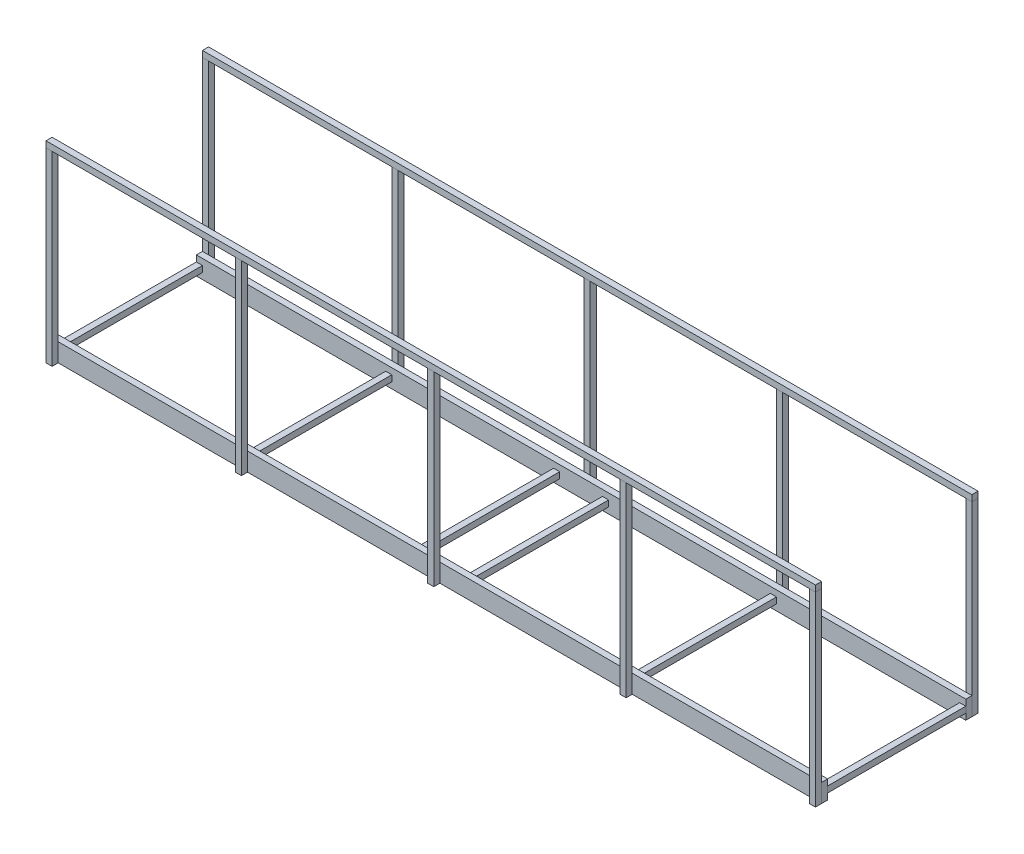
ISO-10303-21;
HEADER;
FILE_DESCRIPTION(('STEP AP214'),'2;1');
FILE_NAME('part.step','',(''),(''),'','','');
FILE_SCHEMA(('AUTOMOTIVE_DESIGN { 1 0 10303 214 1 1 1 1 }'));
ENDSEC;
DATA;
#1=APPLICATION_CONTEXT('core data for automotive mechanical design processes');
#2=APPLICATION_PROTOCOL_DEFINITION('international standard','automotive_design',2000,#1);
#3=PRODUCT_CONTEXT('',#1,'mechanical');
#4=PRODUCT('Part','Part','',(#3));
#5=PRODUCT_RELATED_PRODUCT_CATEGORY('part','',(#4));
#6=PRODUCT_DEFINITION_FORMATION('','',#4);
#7=PRODUCT_DEFINITION_CONTEXT('part definition',#1,'design');
#8=PRODUCT_DEFINITION('design','',#6,#7);
#9=PRODUCT_DEFINITION_SHAPE('','',#8);
#10=(LENGTH_UNIT() NAMED_UNIT(*) SI_UNIT(.MILLI.,.METRE.));
#11=(NAMED_UNIT(*) PLANE_ANGLE_UNIT() SI_UNIT($,.RADIAN.));
#12=(NAMED_UNIT(*) SI_UNIT($,.STERADIAN.) SOLID_ANGLE_UNIT());
#13=UNCERTAINTY_MEASURE_WITH_UNIT(LENGTH_MEASURE(1.E-05),#10,'distance_accuracy_value','');
#14=(GEOMETRIC_REPRESENTATION_CONTEXT(3) GLOBAL_UNCERTAINTY_ASSIGNED_CONTEXT((#13)) GLOBAL_UNIT_ASSIGNED_CONTEXT((#10,
#11,#12)) REPRESENTATION_CONTEXT('',''));
#15=CARTESIAN_POINT('',(0.,0.,0.));
#16=DIRECTION('',(0.,0.,1.));
#17=DIRECTION('',(1.,0.,0.));
#18=AXIS2_PLACEMENT_3D('',#15,#16,#17);
#19=CARTESIAN_POINT('',(-196.825,95.2374999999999,-39.0875));
#20=DIRECTION('',(-1.,0.,0.));
#21=DIRECTION('',(0.,-1.,0.));
#22=AXIS2_PLACEMENT_3D('',#19,#20,#21);
#23=PLANE('',#22);
#24=DIRECTION('',(0.,0.,-1.));
#25=VECTOR('',#24,1.);
#26=CARTESIAN_POINT('',(-196.825,-4.7625,-39.0875));
#27=LINE('',#26,#25);
#28=CARTESIAN_POINT('',(-196.825,-4.7625,-39.0875));
#29=VERTEX_POINT('',#28);
#30=CARTESIAN_POINT('',(-196.825,-4.7625,-42.2625));
#31=VERTEX_POINT('',#30);
#32=EDGE_CURVE('E296',#29,#31,#27,.T.);
#33=ORIENTED_EDGE('',*,*,#32,.T.);
#34=DIRECTION('',(0.,-1.,0.));
#35=VECTOR('',#34,1.);
#36=CARTESIAN_POINT('',(-196.825,95.2374999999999,-42.2625));
#37=LINE('',#36,#35);
#38=CARTESIAN_POINT('',(-196.825,92.0624999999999,-42.2625));
#39=VERTEX_POINT('',#38);
#40=EDGE_CURVE('E289',#39,#31,#37,.T.);
#41=ORIENTED_EDGE('',*,*,#40,.F.);
#42=DIRECTION('',(0.,0.,-1.));
#43=VECTOR('',#42,1.);
#44=CARTESIAN_POINT('',(-196.825,92.0624999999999,-39.0875));
#45=LINE('',#44,#43);
#46=CARTESIAN_POINT('',(-196.825,92.0624999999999,-39.0875));
#47=VERTEX_POINT('',#46);
#48=EDGE_CURVE('E264',#47,#39,#45,.T.);
#49=ORIENTED_EDGE('',*,*,#48,.F.);
#50=DIRECTION('',(0.,-1.,0.));
#51=VECTOR('',#50,1.);
#52=CARTESIAN_POINT('',(-196.825,95.2374999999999,-39.0875));
#53=LINE('',#52,#51);
#54=EDGE_CURVE('E237',#47,#29,#53,.T.);
#55=ORIENTED_EDGE('',*,*,#54,.T.);
#56=EDGE_LOOP('',(#33,#41,#49,#55));
#57=FACE_BOUND('',#56,.T.);
#58=ADVANCED_FACE('F233',(#57),#23,.F.);
#59=CARTESIAN_POINT('',(-200.,95.2374999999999,-42.2625));
#60=DIRECTION('',(0.,0.,1.));
#61=DIRECTION('',(1.,0.,0.));
#62=AXIS2_PLACEMENT_3D('',#59,#60,#61);
#63=PLANE('',#62);
#64=DIRECTION('',(-1.,0.,0.));
#65=VECTOR('',#64,1.);
#66=CARTESIAN_POINT('',(-200.,-4.7625,-42.2625));
#67=LINE('',#66,#65);
#68=CARTESIAN_POINT('',(-200.,-4.7625,-42.2625));
#69=VERTEX_POINT('',#68);
#70=EDGE_CURVE('E283',#31,#69,#67,.T.);
#71=ORIENTED_EDGE('',*,*,#70,.T.);
#72=DIRECTION('',(0.,-1.,0.));
#73=VECTOR('',#72,1.);
#74=CARTESIAN_POINT('',(-200.,95.2374999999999,-42.2625));
#75=LINE('',#74,#73);
#76=CARTESIAN_POINT('',(-200.,92.0624999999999,-42.2625));
#77=VERTEX_POINT('',#76);
#78=EDGE_CURVE('E275',#77,#69,#75,.T.);
#79=ORIENTED_EDGE('',*,*,#78,.F.);
#80=DIRECTION('',(-1.,0.,0.));
#81=VECTOR('',#80,1.);
#82=CARTESIAN_POINT('',(200.,92.0624999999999,-42.2625));
#83=LINE('',#82,#81);
#84=EDGE_CURVE('E261',#39,#77,#83,.T.);
#85=ORIENTED_EDGE('',*,*,#84,.F.);
#86=ORIENTED_EDGE('',*,*,#40,.T.);
#87=EDGE_LOOP('',(#71,#79,#85,#86));
#88=FACE_BOUND('',#87,.T.);
#89=ADVANCED_FACE('F281',(#88),#63,.F.);
#90=CARTESIAN_POINT('',(-200.,95.2374999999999,-39.0875));
#91=DIRECTION('',(1.,0.,0.));
#92=DIRECTION('',(0.,1.,0.));
#93=AXIS2_PLACEMENT_3D('',#90,#91,#92);
#94=PLANE('',#93);
#95=DIRECTION('',(0.,0.,1.));
#96=VECTOR('',#95,1.);
#97=CARTESIAN_POINT('',(-200.,-4.7625,-39.0875));
#98=LINE('',#97,#96);
#99=CARTESIAN_POINT('',(-200.,-4.7625,-39.0875));
#100=VERTEX_POINT('',#99);
#101=EDGE_CURVE('E285',#69,#100,#98,.T.);
#102=ORIENTED_EDGE('',*,*,#101,.T.);
#103=DIRECTION('',(0.,-1.,0.));
#104=VECTOR('',#103,1.);
#105=CARTESIAN_POINT('',(-200.,95.2374999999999,-39.0875));
#106=LINE('',#105,#104);
#107=CARTESIAN_POINT('',(-200.,92.0624999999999,-39.0875));
#108=VERTEX_POINT('',#107);
#109=EDGE_CURVE('E278',#108,#100,#106,.T.);
#110=ORIENTED_EDGE('',*,*,#109,.F.);
#111=DIRECTION('',(0.,0.,1.));
#112=VECTOR('',#111,1.);
#113=CARTESIAN_POINT('',(-200.,92.0624999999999,-39.0875));
#114=LINE('',#113,#112);
#115=EDGE_CURVE('E243',#77,#108,#114,.T.);
#116=ORIENTED_EDGE('',*,*,#115,.F.);
#117=ORIENTED_EDGE('',*,*,#78,.T.);
#118=EDGE_LOOP('',(#102,#110,#116,#117));
#119=FACE_BOUND('',#118,.T.);
#120=ADVANCED_FACE('F274',(#119),#94,.F.);
#121=CARTESIAN_POINT('',(-200.,95.2374999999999,-39.0875));
#122=DIRECTION('',(0.,0.,-1.));
#123=DIRECTION('',(-1.,0.,0.));
#124=AXIS2_PLACEMENT_3D('',#121,#122,#123);
#125=PLANE('',#124);
#126=DIRECTION('',(1.,0.,0.));
#127=VECTOR('',#126,1.);
#128=CARTESIAN_POINT('',(-200.,-4.7625,-39.0875));
#129=LINE('',#128,#127);
#130=EDGE_CURVE('E284',#100,#29,#129,.T.);
#131=ORIENTED_EDGE('',*,*,#130,.T.);
#132=ORIENTED_EDGE('',*,*,#54,.F.);
#133=DIRECTION('',(1.,0.,0.));
#134=VECTOR('',#133,1.);
#135=CARTESIAN_POINT('',(-200.,92.0624999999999,-39.0875));
#136=LINE('',#135,#134);
#137=EDGE_CURVE('E13',#108,#47,#136,.T.);
#138=ORIENTED_EDGE('',*,*,#137,.F.);
#139=ORIENTED_EDGE('',*,*,#109,.T.);
#140=EDGE_LOOP('',(#131,#132,#138,#139));
#141=FACE_BOUND('',#140,.T.);
#142=ADVANCED_FACE('F307',(#141),#125,.F.);
#143=CARTESIAN_POINT('',(200.,92.0624999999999,-39.0875));
#144=DIRECTION('',(0.,1.,0.));
#145=DIRECTION('',(0.,0.,1.));
#146=AXIS2_PLACEMENT_3D('',#143,#144,#145);
#147=PLANE('',#146);
#148=ORIENTED_EDGE('',*,*,#48,.T.);
#149=ORIENTED_EDGE('',*,*,#84,.T.);
#150=ORIENTED_EDGE('',*,*,#115,.T.);
#151=ORIENTED_EDGE('',*,*,#137,.T.);
#152=EDGE_LOOP('',(#148,#149,#150,#151));
#153=FACE_BOUND('',#152,.T.);
#154=ADVANCED_FACE('F263',(#153),#147,.T.);
#155=CARTESIAN_POINT('',(-196.825,-4.7625,-42.2625));
#156=DIRECTION('',(0.,-1.,0.));
#157=DIRECTION('',(1.,0.,0.));
#158=AXIS2_PLACEMENT_3D('',#155,#156,#157);
#159=PLANE('',#158);
#160=ORIENTED_EDGE('',*,*,#32,.F.);
#161=ORIENTED_EDGE('',*,*,#130,.F.);
#162=ORIENTED_EDGE('',*,*,#101,.F.);
#163=ORIENTED_EDGE('',*,*,#70,.F.);
#164=EDGE_LOOP('',(#160,#161,#162,#163));
#165=FACE_BOUND('',#164,.T.);
#166=ADVANCED_FACE('F235',(#165),#159,.T.);
#167=CLOSED_SHELL('',(#58,#89,#120,#142,#154,#166));
#168=MANIFOLD_SOLID_BREP('B2',#167);
#169=CARTESIAN_POINT('',(-98.4125,95.2375,-39.0875));
#170=DIRECTION('',(-1.,0.,0.));
#171=DIRECTION('',(0.,0.,1.));
#172=AXIS2_PLACEMENT_3D('',#169,#170,#171);
#173=PLANE('',#172);
#174=DIRECTION('',(0.,0.,-1.));
#175=VECTOR('',#174,1.);
#176=CARTESIAN_POINT('',(-98.4125,-4.76249999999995,-39.0875));
#177=LINE('',#176,#175);
#178=CARTESIAN_POINT('',(-98.4125,-4.76249999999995,-39.0875));
#179=VERTEX_POINT('',#178);
#180=CARTESIAN_POINT('',(-98.4125,-4.76249999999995,-42.2625));
#181=VERTEX_POINT('',#180);
#182=EDGE_CURVE('E441',#179,#181,#177,.T.);
#183=ORIENTED_EDGE('',*,*,#182,.T.);
#184=DIRECTION('',(0.,-1.,0.));
#185=VECTOR('',#184,1.);
#186=CARTESIAN_POINT('',(-98.4125,95.2375,-42.2625));
#187=LINE('',#186,#185);
#188=CARTESIAN_POINT('',(-98.4124999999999,92.0624999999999,-42.2625));
#189=VERTEX_POINT('',#188);
#190=EDGE_CURVE('E434',#189,#181,#187,.T.);
#191=ORIENTED_EDGE('',*,*,#190,.F.);
#192=DIRECTION('',(0.,0.,-1.));
#193=VECTOR('',#192,1.);
#194=CARTESIAN_POINT('',(-98.4125,92.0624999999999,-39.0875));
#195=LINE('',#194,#193);
#196=CARTESIAN_POINT('',(-98.4124999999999,92.0624999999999,-39.0875));
#197=VERTEX_POINT('',#196);
#198=EDGE_CURVE('E409',#197,#189,#195,.T.);
#199=ORIENTED_EDGE('',*,*,#198,.F.);
#200=DIRECTION('',(0.,-1.,0.));
#201=VECTOR('',#200,1.);
#202=CARTESIAN_POINT('',(-98.4125,95.2375,-39.0875));
#203=LINE('',#202,#201);
#204=EDGE_CURVE('E382',#197,#179,#203,.T.);
#205=ORIENTED_EDGE('',*,*,#204,.T.);
#206=EDGE_LOOP('',(#183,#191,#199,#205));
#207=FACE_BOUND('',#206,.T.);
#208=ADVANCED_FACE('F378',(#207),#173,.F.);
#209=CARTESIAN_POINT('',(-101.5875,95.2375,-42.2625));
#210=DIRECTION('',(0.,0.,1.));
#211=DIRECTION('',(1.,0.,0.));
#212=AXIS2_PLACEMENT_3D('',#209,#210,#211);
#213=PLANE('',#212);
#214=DIRECTION('',(-1.,0.,0.));
#215=VECTOR('',#214,1.);
#216=CARTESIAN_POINT('',(-101.5875,-4.76249999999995,-42.2625));
#217=LINE('',#216,#215);
#218=CARTESIAN_POINT('',(-101.5875,-4.76249999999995,-42.2625));
#219=VERTEX_POINT('',#218);
#220=EDGE_CURVE('E428',#181,#219,#217,.T.);
#221=ORIENTED_EDGE('',*,*,#220,.T.);
#222=DIRECTION('',(0.,-1.,0.));
#223=VECTOR('',#222,1.);
#224=CARTESIAN_POINT('',(-101.5875,95.2375,-42.2625));
#225=LINE('',#224,#223);
#226=CARTESIAN_POINT('',(-101.5875,92.0624999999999,-42.2625));
#227=VERTEX_POINT('',#226);
#228=EDGE_CURVE('E420',#227,#219,#225,.T.);
#229=ORIENTED_EDGE('',*,*,#228,.F.);
#230=DIRECTION('',(-1.,0.,0.));
#231=VECTOR('',#230,1.);
#232=CARTESIAN_POINT('',(200.,92.0624999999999,-42.2625));
#233=LINE('',#232,#231);
#234=EDGE_CURVE('E406',#189,#227,#233,.T.);
#235=ORIENTED_EDGE('',*,*,#234,.F.);
#236=ORIENTED_EDGE('',*,*,#190,.T.);
#237=EDGE_LOOP('',(#221,#229,#235,#236));
#238=FACE_BOUND('',#237,.T.);
#239=ADVANCED_FACE('F426',(#238),#213,.F.);
#240=CARTESIAN_POINT('',(-101.5875,95.2375,-39.0875));
#241=DIRECTION('',(1.,0.,0.));
#242=DIRECTION('',(0.,0.,-1.));
#243=AXIS2_PLACEMENT_3D('',#240,#241,#242);
#244=PLANE('',#243);
#245=DIRECTION('',(0.,0.,1.));
#246=VECTOR('',#245,1.);
#247=CARTESIAN_POINT('',(-101.5875,-4.76249999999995,-39.0875));
#248=LINE('',#247,#246);
#249=CARTESIAN_POINT('',(-101.5875,-4.76249999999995,-39.0875));
#250=VERTEX_POINT('',#249);
#251=EDGE_CURVE('E430',#219,#250,#248,.T.);
#252=ORIENTED_EDGE('',*,*,#251,.T.);
#253=DIRECTION('',(0.,-1.,0.));
#254=VECTOR('',#253,1.);
#255=CARTESIAN_POINT('',(-101.5875,95.2375,-39.0875));
#256=LINE('',#255,#254);
#257=CARTESIAN_POINT('',(-101.5875,92.0624999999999,-39.0875));
#258=VERTEX_POINT('',#257);
#259=EDGE_CURVE('E423',#258,#250,#256,.T.);
#260=ORIENTED_EDGE('',*,*,#259,.F.);
#261=DIRECTION('',(0.,0.,1.));
#262=VECTOR('',#261,1.);
#263=CARTESIAN_POINT('',(-101.5875,92.0624999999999,-39.0875));
#264=LINE('',#263,#262);
#265=EDGE_CURVE('E388',#227,#258,#264,.T.);
#266=ORIENTED_EDGE('',*,*,#265,.F.);
#267=ORIENTED_EDGE('',*,*,#228,.T.);
#268=EDGE_LOOP('',(#252,#260,#266,#267));
#269=FACE_BOUND('',#268,.T.);
#270=ADVANCED_FACE('F419',(#269),#244,.F.);
#271=CARTESIAN_POINT('',(-101.5875,95.2375,-39.0875));
#272=DIRECTION('',(0.,0.,-1.));
#273=DIRECTION('',(-1.,0.,0.));
#274=AXIS2_PLACEMENT_3D('',#271,#272,#273);
#275=PLANE('',#274);
#276=DIRECTION('',(1.,0.,0.));
#277=VECTOR('',#276,1.);
#278=CARTESIAN_POINT('',(-101.5875,-4.76249999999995,-39.0875));
#279=LINE('',#278,#277);
#280=EDGE_CURVE('E429',#250,#179,#279,.T.);
#281=ORIENTED_EDGE('',*,*,#280,.T.);
#282=ORIENTED_EDGE('',*,*,#204,.F.);
#283=DIRECTION('',(1.,0.,0.));
#284=VECTOR('',#283,1.);
#285=CARTESIAN_POINT('',(-101.5875,92.0624999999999,-39.0875));
#286=LINE('',#285,#284);
#287=EDGE_CURVE('E231',#258,#197,#286,.T.);
#288=ORIENTED_EDGE('',*,*,#287,.F.);
#289=ORIENTED_EDGE('',*,*,#259,.T.);
#290=EDGE_LOOP('',(#281,#282,#288,#289));
#291=FACE_BOUND('',#290,.T.);
#292=ADVANCED_FACE('F452',(#291),#275,.F.);
#293=CARTESIAN_POINT('',(200.,92.0624999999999,-39.0875));
#294=DIRECTION('',(0.,1.,0.));
#295=DIRECTION('',(0.,0.,1.));
#296=AXIS2_PLACEMENT_3D('',#293,#294,#295);
#297=PLANE('',#296);
#298=ORIENTED_EDGE('',*,*,#198,.T.);
#299=ORIENTED_EDGE('',*,*,#234,.T.);
#300=ORIENTED_EDGE('',*,*,#265,.T.);
#301=ORIENTED_EDGE('',*,*,#287,.T.);
#302=EDGE_LOOP('',(#298,#299,#300,#301));
#303=FACE_BOUND('',#302,.T.);
#304=ADVANCED_FACE('F408',(#303),#297,.T.);
#305=CARTESIAN_POINT('',(-98.4125,-4.76249999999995,-42.2625));
#306=DIRECTION('',(0.,-1.,0.));
#307=DIRECTION('',(0.,0.,-1.));
#308=AXIS2_PLACEMENT_3D('',#305,#306,#307);
#309=PLANE('',#308);
#310=ORIENTED_EDGE('',*,*,#182,.F.);
#311=ORIENTED_EDGE('',*,*,#280,.F.);
#312=ORIENTED_EDGE('',*,*,#251,.F.);
#313=ORIENTED_EDGE('',*,*,#220,.F.);
#314=EDGE_LOOP('',(#310,#311,#312,#313));
#315=FACE_BOUND('',#314,.T.);
#316=ADVANCED_FACE('F380',(#315),#309,.T.);
#317=CLOSED_SHELL('',(#208,#239,#270,#292,#304,#316));
#318=MANIFOLD_SOLID_BREP('B7',#317);
#319=CARTESIAN_POINT('',(1.58750000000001,95.2375,-39.0875));
#320=DIRECTION('',(-1.,0.,0.));
#321=DIRECTION('',(0.,-1.,0.));
#322=AXIS2_PLACEMENT_3D('',#319,#320,#321);
#323=PLANE('',#322);
#324=DIRECTION('',(0.,0.,-1.));
#325=VECTOR('',#324,1.);
#326=CARTESIAN_POINT('',(1.58749999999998,-4.7625,-39.0875));
#327=LINE('',#326,#325);
#328=CARTESIAN_POINT('',(1.58749999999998,-4.7625,-39.0875));
#329=VERTEX_POINT('',#328);
#330=CARTESIAN_POINT('',(1.58749999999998,-4.7625,-42.2625));
#331=VERTEX_POINT('',#330);
#332=EDGE_CURVE('E586',#329,#331,#327,.T.);
#333=ORIENTED_EDGE('',*,*,#332,.T.);
#334=DIRECTION('',(0.,-1.,0.));
#335=VECTOR('',#334,1.);
#336=CARTESIAN_POINT('',(1.58750000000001,95.2375,-42.2625));
#337=LINE('',#336,#335);
#338=CARTESIAN_POINT('',(1.58750000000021,92.0624999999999,-42.2625));
#339=VERTEX_POINT('',#338);
#340=EDGE_CURVE('E579',#339,#331,#337,.T.);
#341=ORIENTED_EDGE('',*,*,#340,.F.);
#342=DIRECTION('',(0.,0.,-1.));
#343=VECTOR('',#342,1.);
#344=CARTESIAN_POINT('',(1.5875,92.0624999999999,-39.0875));
#345=LINE('',#344,#343);
#346=CARTESIAN_POINT('',(1.58750000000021,92.0624999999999,-39.0875));
#347=VERTEX_POINT('',#346);
#348=EDGE_CURVE('E554',#347,#339,#345,.T.);
#349=ORIENTED_EDGE('',*,*,#348,.F.);
#350=DIRECTION('',(0.,-1.,0.));
#351=VECTOR('',#350,1.);
#352=CARTESIAN_POINT('',(1.58750000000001,95.2375,-39.0875));
#353=LINE('',#352,#351);
#354=EDGE_CURVE('E527',#347,#329,#353,.T.);
#355=ORIENTED_EDGE('',*,*,#354,.T.);
#356=EDGE_LOOP('',(#333,#341,#349,#355));
#357=FACE_BOUND('',#356,.T.);
#358=ADVANCED_FACE('F523',(#357),#323,.F.);
#359=CARTESIAN_POINT('',(-1.58750000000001,95.2375,-42.2625));
#360=DIRECTION('',(0.,0.,1.));
#361=DIRECTION('',(1.,0.,0.));
#362=AXIS2_PLACEMENT_3D('',#359,#360,#361);
#363=PLANE('',#362);
#364=DIRECTION('',(-1.,0.,0.));
#365=VECTOR('',#364,1.);
#366=CARTESIAN_POINT('',(-1.58750000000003,-4.7625,-42.2625));
#367=LINE('',#366,#365);
#368=CARTESIAN_POINT('',(-1.58750000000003,-4.7625,-42.2625));
#369=VERTEX_POINT('',#368);
#370=EDGE_CURVE('E573',#331,#369,#367,.T.);
#371=ORIENTED_EDGE('',*,*,#370,.T.);
#372=DIRECTION('',(0.,-1.,0.));
#373=VECTOR('',#372,1.);
#374=CARTESIAN_POINT('',(-1.58750000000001,95.2375,-42.2625));
#375=LINE('',#374,#373);
#376=CARTESIAN_POINT('',(-1.58749999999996,92.0624999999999,-42.2625));
#377=VERTEX_POINT('',#376);
#378=EDGE_CURVE('E565',#377,#369,#375,.T.);
#379=ORIENTED_EDGE('',*,*,#378,.F.);
#380=DIRECTION('',(-1.,0.,0.));
#381=VECTOR('',#380,1.);
#382=CARTESIAN_POINT('',(200.,92.0624999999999,-42.2625));
#383=LINE('',#382,#381);
#384=EDGE_CURVE('E551',#339,#377,#383,.T.);
#385=ORIENTED_EDGE('',*,*,#384,.F.);
#386=ORIENTED_EDGE('',*,*,#340,.T.);
#387=EDGE_LOOP('',(#371,#379,#385,#386));
#388=FACE_BOUND('',#387,.T.);
#389=ADVANCED_FACE('F571',(#388),#363,.F.);
#390=CARTESIAN_POINT('',(-1.58750000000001,95.2375,-39.0875));
#391=DIRECTION('',(1.,0.,0.));
#392=DIRECTION('',(0.,1.,0.));
#393=AXIS2_PLACEMENT_3D('',#390,#391,#392);
#394=PLANE('',#393);
#395=DIRECTION('',(0.,0.,1.));
#396=VECTOR('',#395,1.);
#397=CARTESIAN_POINT('',(-1.58750000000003,-4.7625,-39.0875));
#398=LINE('',#397,#396);
#399=CARTESIAN_POINT('',(-1.58750000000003,-4.7625,-39.0875));
#400=VERTEX_POINT('',#399);
#401=EDGE_CURVE('E575',#369,#400,#398,.T.);
#402=ORIENTED_EDGE('',*,*,#401,.T.);
#403=DIRECTION('',(0.,-1.,0.));
#404=VECTOR('',#403,1.);
#405=CARTESIAN_POINT('',(-1.58750000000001,95.2375,-39.0875));
#406=LINE('',#405,#404);
#407=CARTESIAN_POINT('',(-1.58750000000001,92.0624999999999,-39.0875));
#408=VERTEX_POINT('',#407);
#409=EDGE_CURVE('E568',#408,#400,#406,.T.);
#410=ORIENTED_EDGE('',*,*,#409,.F.);
#411=DIRECTION('',(0.,0.,1.));
#412=VECTOR('',#411,1.);
#413=CARTESIAN_POINT('',(-1.58750000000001,92.0624999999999,-39.0875));
#414=LINE('',#413,#412);
#415=EDGE_CURVE('E533',#377,#408,#414,.T.);
#416=ORIENTED_EDGE('',*,*,#415,.F.);
#417=ORIENTED_EDGE('',*,*,#378,.T.);
#418=EDGE_LOOP('',(#402,#410,#416,#417));
#419=FACE_BOUND('',#418,.T.);
#420=ADVANCED_FACE('F564',(#419),#394,.F.);
#421=CARTESIAN_POINT('',(-1.58750000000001,95.2375,-39.0875));
#422=DIRECTION('',(0.,0.,-1.));
#423=DIRECTION('',(-1.,0.,0.));
#424=AXIS2_PLACEMENT_3D('',#421,#422,#423);
#425=PLANE('',#424);
#426=DIRECTION('',(1.,0.,0.));
#427=VECTOR('',#426,1.);
#428=CARTESIAN_POINT('',(-1.58750000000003,-4.7625,-39.0875));
#429=LINE('',#428,#427);
#430=EDGE_CURVE('E574',#400,#329,#429,.T.);
#431=ORIENTED_EDGE('',*,*,#430,.T.);
#432=ORIENTED_EDGE('',*,*,#354,.F.);
#433=DIRECTION('',(1.,0.,0.));
#434=VECTOR('',#433,1.);
#435=CARTESIAN_POINT('',(-1.58750000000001,92.0624999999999,-39.0875));
#436=LINE('',#435,#434);
#437=EDGE_CURVE('E376',#408,#347,#436,.T.);
#438=ORIENTED_EDGE('',*,*,#437,.F.);
#439=ORIENTED_EDGE('',*,*,#409,.T.);
#440=EDGE_LOOP('',(#431,#432,#438,#439));
#441=FACE_BOUND('',#440,.T.);
#442=ADVANCED_FACE('F597',(#441),#425,.F.);
#443=CARTESIAN_POINT('',(200.,92.0624999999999,-39.0875));
#444=DIRECTION('',(0.,1.,0.));
#445=DIRECTION('',(0.,0.,1.));
#446=AXIS2_PLACEMENT_3D('',#443,#444,#445);
#447=PLANE('',#446);
#448=ORIENTED_EDGE('',*,*,#348,.T.);
#449=ORIENTED_EDGE('',*,*,#384,.T.);
#450=ORIENTED_EDGE('',*,*,#415,.T.);
#451=ORIENTED_EDGE('',*,*,#437,.T.);
#452=EDGE_LOOP('',(#448,#449,#450,#451));
#453=FACE_BOUND('',#452,.T.);
#454=ADVANCED_FACE('F553',(#453),#447,.T.);
#455=CARTESIAN_POINT('',(1.58749999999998,-4.7625,-42.2625));
#456=DIRECTION('',(0.,-1.,0.));
#457=DIRECTION('',(0.,0.,-1.));
#458=AXIS2_PLACEMENT_3D('',#455,#456,#457);
#459=PLANE('',#458);
#460=ORIENTED_EDGE('',*,*,#332,.F.);
#461=ORIENTED_EDGE('',*,*,#430,.F.);
#462=ORIENTED_EDGE('',*,*,#401,.F.);
#463=ORIENTED_EDGE('',*,*,#370,.F.);
#464=EDGE_LOOP('',(#460,#461,#462,#463));
#465=FACE_BOUND('',#464,.T.);
#466=ADVANCED_FACE('F525',(#465),#459,.T.);
#467=CLOSED_SHELL('',(#358,#389,#420,#442,#454,#466));
#468=MANIFOLD_SOLID_BREP('B225',#467);
#469=CARTESIAN_POINT('',(101.5875,95.2375,-39.0875));
#470=DIRECTION('',(-1.,0.,0.));
#471=DIRECTION('',(0.,0.,1.));
#472=AXIS2_PLACEMENT_3D('',#469,#470,#471);
#473=PLANE('',#472);
#474=DIRECTION('',(0.,0.,-1.));
#475=VECTOR('',#474,1.);
#476=CARTESIAN_POINT('',(101.5875,-4.76249999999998,-39.0875));
#477=LINE('',#476,#475);
#478=CARTESIAN_POINT('',(101.5875,-4.76249999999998,-39.0875));
#479=VERTEX_POINT('',#478);
#480=CARTESIAN_POINT('',(101.5875,-4.76249999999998,-42.2625));
#481=VERTEX_POINT('',#480);
#482=EDGE_CURVE('E731',#479,#481,#477,.T.);
#483=ORIENTED_EDGE('',*,*,#482,.T.);
#484=DIRECTION('',(0.,-1.,0.));
#485=VECTOR('',#484,1.);
#486=CARTESIAN_POINT('',(101.5875,95.2375,-42.2625));
#487=LINE('',#486,#485);
#488=CARTESIAN_POINT('',(101.5875,92.0624999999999,-42.2625));
#489=VERTEX_POINT('',#488);
#490=EDGE_CURVE('E724',#489,#481,#487,.T.);
#491=ORIENTED_EDGE('',*,*,#490,.F.);
#492=DIRECTION('',(0.,0.,-1.));
#493=VECTOR('',#492,1.);
#494=CARTESIAN_POINT('',(101.5875,92.0624999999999,-39.0875));
#495=LINE('',#494,#493);
#496=CARTESIAN_POINT('',(101.5875,92.0624999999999,-39.0875));
#497=VERTEX_POINT('',#496);
#498=EDGE_CURVE('E699',#497,#489,#495,.T.);
#499=ORIENTED_EDGE('',*,*,#498,.F.);
#500=DIRECTION('',(0.,-1.,0.));
#501=VECTOR('',#500,1.);
#502=CARTESIAN_POINT('',(101.5875,95.2375,-39.0875));
#503=LINE('',#502,#501);
#504=EDGE_CURVE('E672',#497,#479,#503,.T.);
#505=ORIENTED_EDGE('',*,*,#504,.T.);
#506=EDGE_LOOP('',(#483,#491,#499,#505));
#507=FACE_BOUND('',#506,.T.);
#508=ADVANCED_FACE('F668',(#507),#473,.F.);
#509=CARTESIAN_POINT('',(98.4125,95.2375,-42.2625));
#510=DIRECTION('',(0.,0.,1.));
#511=DIRECTION('',(1.,0.,0.));
#512=AXIS2_PLACEMENT_3D('',#509,#510,#511);
#513=PLANE('',#512);
#514=DIRECTION('',(-1.,0.,0.));
#515=VECTOR('',#514,1.);
#516=CARTESIAN_POINT('',(98.4125,-4.76249999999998,-42.2625));
#517=LINE('',#516,#515);
#518=CARTESIAN_POINT('',(98.4125,-4.76249999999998,-42.2625));
#519=VERTEX_POINT('',#518);
#520=EDGE_CURVE('E718',#481,#519,#517,.T.);
#521=ORIENTED_EDGE('',*,*,#520,.T.);
#522=DIRECTION('',(0.,-1.,0.));
#523=VECTOR('',#522,1.);
#524=CARTESIAN_POINT('',(98.4125,95.2375,-42.2625));
#525=LINE('',#524,#523);
#526=CARTESIAN_POINT('',(98.4125000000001,92.0624999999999,-42.2625));
#527=VERTEX_POINT('',#526);
#528=EDGE_CURVE('E710',#527,#519,#525,.T.);
#529=ORIENTED_EDGE('',*,*,#528,.F.);
#530=DIRECTION('',(-1.,0.,0.));
#531=VECTOR('',#530,1.);
#532=CARTESIAN_POINT('',(200.,92.0624999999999,-42.2625));
#533=LINE('',#532,#531);
#534=EDGE_CURVE('E696',#489,#527,#533,.T.);
#535=ORIENTED_EDGE('',*,*,#534,.F.);
#536=ORIENTED_EDGE('',*,*,#490,.T.);
#537=EDGE_LOOP('',(#521,#529,#535,#536));
#538=FACE_BOUND('',#537,.T.);
#539=ADVANCED_FACE('F716',(#538),#513,.F.);
#540=CARTESIAN_POINT('',(98.4125,95.2375,-39.0875));
#541=DIRECTION('',(1.,0.,0.));
#542=DIRECTION('',(0.,0.,-1.));
#543=AXIS2_PLACEMENT_3D('',#540,#541,#542);
#544=PLANE('',#543);
#545=DIRECTION('',(0.,0.,1.));
#546=VECTOR('',#545,1.);
#547=CARTESIAN_POINT('',(98.4125,-4.76249999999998,-39.0875));
#548=LINE('',#547,#546);
#549=CARTESIAN_POINT('',(98.4125,-4.76249999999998,-39.0875));
#550=VERTEX_POINT('',#549);
#551=EDGE_CURVE('E720',#519,#550,#548,.T.);
#552=ORIENTED_EDGE('',*,*,#551,.T.);
#553=DIRECTION('',(0.,-1.,0.));
#554=VECTOR('',#553,1.);
#555=CARTESIAN_POINT('',(98.4125,95.2375,-39.0875));
#556=LINE('',#555,#554);
#557=CARTESIAN_POINT('',(98.4125,92.0624999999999,-39.0875));
#558=VERTEX_POINT('',#557);
#559=EDGE_CURVE('E713',#558,#550,#556,.T.);
#560=ORIENTED_EDGE('',*,*,#559,.F.);
#561=DIRECTION('',(0.,0.,1.));
#562=VECTOR('',#561,1.);
#563=CARTESIAN_POINT('',(98.4125,92.0624999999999,-39.0875));
#564=LINE('',#563,#562);
#565=EDGE_CURVE('E678',#527,#558,#564,.T.);
#566=ORIENTED_EDGE('',*,*,#565,.F.);
#567=ORIENTED_EDGE('',*,*,#528,.T.);
#568=EDGE_LOOP('',(#552,#560,#566,#567));
#569=FACE_BOUND('',#568,.T.);
#570=ADVANCED_FACE('F709',(#569),#544,.F.);
#571=CARTESIAN_POINT('',(98.4125,95.2375,-39.0875));
#572=DIRECTION('',(0.,0.,-1.));
#573=DIRECTION('',(-1.,0.,0.));
#574=AXIS2_PLACEMENT_3D('',#571,#572,#573);
#575=PLANE('',#574);
#576=DIRECTION('',(1.,0.,0.));
#577=VECTOR('',#576,1.);
#578=CARTESIAN_POINT('',(98.4125,-4.76249999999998,-39.0875));
#579=LINE('',#578,#577);
#580=EDGE_CURVE('E719',#550,#479,#579,.T.);
#581=ORIENTED_EDGE('',*,*,#580,.T.);
#582=ORIENTED_EDGE('',*,*,#504,.F.);
#583=DIRECTION('',(1.,0.,0.));
#584=VECTOR('',#583,1.);
#585=CARTESIAN_POINT('',(98.4125,92.0624999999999,-39.0875));
#586=LINE('',#585,#584);
#587=EDGE_CURVE('E521',#558,#497,#586,.T.);
#588=ORIENTED_EDGE('',*,*,#587,.F.);
#589=ORIENTED_EDGE('',*,*,#559,.T.);
#590=EDGE_LOOP('',(#581,#582,#588,#589));
#591=FACE_BOUND('',#590,.T.);
#592=ADVANCED_FACE('F742',(#591),#575,.F.);
#593=CARTESIAN_POINT('',(200.,92.0624999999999,-39.0875));
#594=DIRECTION('',(0.,1.,0.));
#595=DIRECTION('',(0.,0.,1.));
#596=AXIS2_PLACEMENT_3D('',#593,#594,#595);
#597=PLANE('',#596);
#598=ORIENTED_EDGE('',*,*,#498,.T.);
#599=ORIENTED_EDGE('',*,*,#534,.T.);
#600=ORIENTED_EDGE('',*,*,#565,.T.);
#601=ORIENTED_EDGE('',*,*,#587,.T.);
#602=EDGE_LOOP('',(#598,#599,#600,#601));
#603=FACE_BOUND('',#602,.T.);
#604=ADVANCED_FACE('F698',(#603),#597,.T.);
#605=CARTESIAN_POINT('',(101.5875,-4.76249999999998,-42.2625));
#606=DIRECTION('',(0.,-1.,0.));
#607=DIRECTION('',(0.,0.,-1.));
#608=AXIS2_PLACEMENT_3D('',#605,#606,#607);
#609=PLANE('',#608);
#610=ORIENTED_EDGE('',*,*,#482,.F.);
#611=ORIENTED_EDGE('',*,*,#580,.F.);
#612=ORIENTED_EDGE('',*,*,#551,.F.);
#613=ORIENTED_EDGE('',*,*,#520,.F.);
#614=EDGE_LOOP('',(#610,#611,#612,#613));
#615=FACE_BOUND('',#614,.T.);
#616=ADVANCED_FACE('F670',(#615),#609,.T.);
#617=CLOSED_SHELL('',(#508,#539,#570,#592,#604,#616));
#618=MANIFOLD_SOLID_BREP('B370',#617);
#619=CARTESIAN_POINT('',(200.,95.2374999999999,-39.0875));
#620=DIRECTION('',(-1.,0.,0.));
#621=DIRECTION('',(0.,0.,1.));
#622=AXIS2_PLACEMENT_3D('',#619,#620,#621);
#623=PLANE('',#622);
#624=DIRECTION('',(0.,0.,-1.));
#625=VECTOR('',#624,1.);
#626=CARTESIAN_POINT('',(200.,-4.7625,-39.0875));
#627=LINE('',#626,#625);
#628=CARTESIAN_POINT('',(200.,-4.7625,-39.0875));
#629=VERTEX_POINT('',#628);
#630=CARTESIAN_POINT('',(200.,-4.7625,-42.2625));
#631=VERTEX_POINT('',#630);
#632=EDGE_CURVE('E876',#629,#631,#627,.T.);
#633=ORIENTED_EDGE('',*,*,#632,.T.);
#634=DIRECTION('',(0.,-1.,0.));
#635=VECTOR('',#634,1.);
#636=CARTESIAN_POINT('',(200.,95.2374999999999,-42.2625));
#637=LINE('',#636,#635);
#638=CARTESIAN_POINT('',(200.,92.0624999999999,-42.2625));
#639=VERTEX_POINT('',#638);
#640=EDGE_CURVE('E869',#639,#631,#637,.T.);
#641=ORIENTED_EDGE('',*,*,#640,.F.);
#642=DIRECTION('',(0.,0.,-1.));
#643=VECTOR('',#642,1.);
#644=CARTESIAN_POINT('',(200.,92.0624999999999,-39.0875));
#645=LINE('',#644,#643);
#646=CARTESIAN_POINT('',(200.,92.0624999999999,-39.0875));
#647=VERTEX_POINT('',#646);
#648=EDGE_CURVE('E844',#647,#639,#645,.T.);
#649=ORIENTED_EDGE('',*,*,#648,.F.);
#650=DIRECTION('',(0.,-1.,0.));
#651=VECTOR('',#650,1.);
#652=CARTESIAN_POINT('',(200.,95.2374999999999,-39.0875));
#653=LINE('',#652,#651);
#654=EDGE_CURVE('E817',#647,#629,#653,.T.);
#655=ORIENTED_EDGE('',*,*,#654,.T.);
#656=EDGE_LOOP('',(#633,#641,#649,#655));
#657=FACE_BOUND('',#656,.T.);
#658=ADVANCED_FACE('F813',(#657),#623,.F.);
#659=CARTESIAN_POINT('',(196.825,95.2374999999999,-42.2625));
#660=DIRECTION('',(0.,0.,1.));
#661=DIRECTION('',(1.,0.,0.));
#662=AXIS2_PLACEMENT_3D('',#659,#660,#661);
#663=PLANE('',#662);
#664=DIRECTION('',(-1.,0.,0.));
#665=VECTOR('',#664,1.);
#666=CARTESIAN_POINT('',(196.825,-4.7625,-42.2625));
#667=LINE('',#666,#665);
#668=CARTESIAN_POINT('',(196.825,-4.7625,-42.2625));
#669=VERTEX_POINT('',#668);
#670=EDGE_CURVE('E863',#631,#669,#667,.T.);
#671=ORIENTED_EDGE('',*,*,#670,.T.);
#672=DIRECTION('',(0.,-1.,0.));
#673=VECTOR('',#672,1.);
#674=CARTESIAN_POINT('',(196.825,95.2374999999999,-42.2625));
#675=LINE('',#674,#673);
#676=CARTESIAN_POINT('',(196.825,92.0624999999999,-42.2625));
#677=VERTEX_POINT('',#676);
#678=EDGE_CURVE('E855',#677,#669,#675,.T.);
#679=ORIENTED_EDGE('',*,*,#678,.F.);
#680=DIRECTION('',(-1.,0.,0.));
#681=VECTOR('',#680,1.);
#682=CARTESIAN_POINT('',(200.,92.0624999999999,-42.2625));
#683=LINE('',#682,#681);
#684=EDGE_CURVE('E841',#639,#677,#683,.T.);
#685=ORIENTED_EDGE('',*,*,#684,.F.);
#686=ORIENTED_EDGE('',*,*,#640,.T.);
#687=EDGE_LOOP('',(#671,#679,#685,#686));
#688=FACE_BOUND('',#687,.T.);
#689=ADVANCED_FACE('F861',(#688),#663,.F.);
#690=CARTESIAN_POINT('',(196.825,95.2374999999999,-39.0875));
#691=DIRECTION('',(1.,0.,0.));
#692=DIRECTION('',(0.,0.,-1.));
#693=AXIS2_PLACEMENT_3D('',#690,#691,#692);
#694=PLANE('',#693);
#695=DIRECTION('',(0.,0.,1.));
#696=VECTOR('',#695,1.);
#697=CARTESIAN_POINT('',(196.825,-4.7625,-39.0875));
#698=LINE('',#697,#696);
#699=CARTESIAN_POINT('',(196.825,-4.7625,-39.0875));
#700=VERTEX_POINT('',#699);
#701=EDGE_CURVE('E865',#669,#700,#698,.T.);
#702=ORIENTED_EDGE('',*,*,#701,.T.);
#703=DIRECTION('',(0.,-1.,0.));
#704=VECTOR('',#703,1.);
#705=CARTESIAN_POINT('',(196.825,95.2374999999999,-39.0875));
#706=LINE('',#705,#704);
#707=CARTESIAN_POINT('',(196.825,92.0624999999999,-39.0875));
#708=VERTEX_POINT('',#707);
#709=EDGE_CURVE('E858',#708,#700,#706,.T.);
#710=ORIENTED_EDGE('',*,*,#709,.F.);
#711=DIRECTION('',(0.,0.,1.));
#712=VECTOR('',#711,1.);
#713=CARTESIAN_POINT('',(196.825,92.0624999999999,-39.0875));
#714=LINE('',#713,#712);
#715=EDGE_CURVE('E823',#677,#708,#714,.T.);
#716=ORIENTED_EDGE('',*,*,#715,.F.);
#717=ORIENTED_EDGE('',*,*,#678,.T.);
#718=EDGE_LOOP('',(#702,#710,#716,#717));
#719=FACE_BOUND('',#718,.T.);
#720=ADVANCED_FACE('F854',(#719),#694,.F.);
#721=CARTESIAN_POINT('',(196.825,95.2374999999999,-39.0875));
#722=DIRECTION('',(0.,0.,-1.));
#723=DIRECTION('',(-1.,0.,0.));
#724=AXIS2_PLACEMENT_3D('',#721,#722,#723);
#725=PLANE('',#724);
#726=DIRECTION('',(1.,0.,0.));
#727=VECTOR('',#726,1.);
#728=CARTESIAN_POINT('',(196.825,-4.7625,-39.0875));
#729=LINE('',#728,#727);
#730=EDGE_CURVE('E864',#700,#629,#729,.T.);
#731=ORIENTED_EDGE('',*,*,#730,.T.);
#732=ORIENTED_EDGE('',*,*,#654,.F.);
#733=DIRECTION('',(1.,0.,0.));
#734=VECTOR('',#733,1.);
#735=CARTESIAN_POINT('',(196.825,92.0624999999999,-39.0875));
#736=LINE('',#735,#734);
#737=EDGE_CURVE('E666',#708,#647,#736,.T.);
#738=ORIENTED_EDGE('',*,*,#737,.F.);
#739=ORIENTED_EDGE('',*,*,#709,.T.);
#740=EDGE_LOOP('',(#731,#732,#738,#739));
#741=FACE_BOUND('',#740,.T.);
#742=ADVANCED_FACE('F887',(#741),#725,.F.);
#743=CARTESIAN_POINT('',(200.,92.0624999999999,-39.0875));
#744=DIRECTION('',(0.,1.,0.));
#745=DIRECTION('',(0.,0.,1.));
#746=AXIS2_PLACEMENT_3D('',#743,#744,#745);
#747=PLANE('',#746);
#748=ORIENTED_EDGE('',*,*,#648,.T.);
#749=ORIENTED_EDGE('',*,*,#684,.T.);
#750=ORIENTED_EDGE('',*,*,#715,.T.);
#751=ORIENTED_EDGE('',*,*,#737,.T.);
#752=EDGE_LOOP('',(#748,#749,#750,#751));
#753=FACE_BOUND('',#752,.T.);
#754=ADVANCED_FACE('F843',(#753),#747,.T.);
#755=CARTESIAN_POINT('',(200.,-4.7625,-42.2625));
#756=DIRECTION('',(0.,-1.,0.));
#757=DIRECTION('',(0.,0.,-1.));
#758=AXIS2_PLACEMENT_3D('',#755,#756,#757);
#759=PLANE('',#758);
#760=ORIENTED_EDGE('',*,*,#632,.F.);
#761=ORIENTED_EDGE('',*,*,#730,.F.);
#762=ORIENTED_EDGE('',*,*,#701,.F.);
#763=ORIENTED_EDGE('',*,*,#670,.F.);
#764=EDGE_LOOP('',(#760,#761,#762,#763));
#765=FACE_BOUND('',#764,.T.);
#766=ADVANCED_FACE('F815',(#765),#759,.T.);
#767=CLOSED_SHELL('',(#658,#689,#720,#742,#754,#766));
#768=MANIFOLD_SOLID_BREP('B515',#767);
#769=CARTESIAN_POINT('',(200.,92.0624999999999,-39.0875));
#770=DIRECTION('',(0.,1.,0.));
#771=DIRECTION('',(0.,0.,1.));
#772=AXIS2_PLACEMENT_3D('',#769,#770,#771);
#773=PLANE('',#772);
#774=DIRECTION('',(0.,0.,-1.));
#775=VECTOR('',#774,1.);
#776=CARTESIAN_POINT('',(-200.,92.0624999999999,-39.0875));
#777=LINE('',#776,#775);
#778=CARTESIAN_POINT('',(-200.,92.0624999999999,-39.0875));
#779=VERTEX_POINT('',#778);
#780=CARTESIAN_POINT('',(-200.,92.0624999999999,-42.2625));
#781=VERTEX_POINT('',#780);
#782=EDGE_CURVE('E1021',#779,#781,#777,.T.);
#783=ORIENTED_EDGE('',*,*,#782,.T.);
#784=DIRECTION('',(-1.,0.,0.));
#785=VECTOR('',#784,1.);
#786=CARTESIAN_POINT('',(200.,92.0624999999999,-42.2625));
#787=LINE('',#786,#785);
#788=CARTESIAN_POINT('',(200.,92.0624999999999,-42.2625));
#789=VERTEX_POINT('',#788);
#790=EDGE_CURVE('E811',#789,#781,#787,.T.);
#791=ORIENTED_EDGE('',*,*,#790,.F.);
#792=DIRECTION('',(0.,0.,-1.));
#793=VECTOR('',#792,1.);
#794=CARTESIAN_POINT('',(200.,92.0624999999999,-39.0875));
#795=LINE('',#794,#793);
#796=CARTESIAN_POINT('',(200.,92.0624999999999,-39.0875));
#797=VERTEX_POINT('',#796);
#798=EDGE_CURVE('E1009',#797,#789,#795,.T.);
#799=ORIENTED_EDGE('',*,*,#798,.F.);
#800=DIRECTION('',(-1.,0.,0.));
#801=VECTOR('',#800,1.);
#802=CARTESIAN_POINT('',(200.,92.0624999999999,-39.0875));
#803=LINE('',#802,#801);
#804=EDGE_CURVE('E1017',#797,#779,#803,.T.);
#805=ORIENTED_EDGE('',*,*,#804,.T.);
#806=EDGE_LOOP('',(#783,#791,#799,#805));
#807=FACE_BOUND('',#806,.T.);
#808=ADVANCED_FACE('F958',(#807),#773,.F.);
#809=CARTESIAN_POINT('',(200.,95.2374999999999,-42.2625));
#810=DIRECTION('',(0.,0.,1.));
#811=DIRECTION('',(1.,0.,0.));
#812=AXIS2_PLACEMENT_3D('',#809,#810,#811);
#813=PLANE('',#812);
#814=DIRECTION('',(0.,1.,0.));
#815=VECTOR('',#814,1.);
#816=CARTESIAN_POINT('',(-200.,95.2374999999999,-42.2625));
#817=LINE('',#816,#815);
#818=CARTESIAN_POINT('',(-200.,95.2374999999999,-42.2625));
#819=VERTEX_POINT('',#818);
#820=EDGE_CURVE('E1013',#781,#819,#817,.T.);
#821=ORIENTED_EDGE('',*,*,#820,.T.);
#822=DIRECTION('',(-1.,0.,0.));
#823=VECTOR('',#822,1.);
#824=CARTESIAN_POINT('',(200.,95.2374999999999,-42.2625));
#825=LINE('',#824,#823);
#826=CARTESIAN_POINT('',(200.,95.2374999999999,-42.2625));
#827=VERTEX_POINT('',#826);
#828=EDGE_CURVE('E966',#827,#819,#825,.T.);
#829=ORIENTED_EDGE('',*,*,#828,.F.);
#830=DIRECTION('',(0.,1.,0.));
#831=VECTOR('',#830,1.);
#832=CARTESIAN_POINT('',(200.,95.2374999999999,-42.2625));
#833=LINE('',#832,#831);
#834=EDGE_CURVE('E1004',#789,#827,#833,.T.);
#835=ORIENTED_EDGE('',*,*,#834,.F.);
#836=ORIENTED_EDGE('',*,*,#790,.T.);
#837=EDGE_LOOP('',(#821,#829,#835,#836));
#838=FACE_BOUND('',#837,.T.);
#839=ADVANCED_FACE('F1012',(#838),#813,.F.);
#840=CARTESIAN_POINT('',(200.,95.2374999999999,-39.0875));
#841=DIRECTION('',(0.,-1.,0.));
#842=DIRECTION('',(0.,0.,-1.));
#843=AXIS2_PLACEMENT_3D('',#840,#841,#842);
#844=PLANE('',#843);
#845=DIRECTION('',(0.,0.,1.));
#846=VECTOR('',#845,1.);
#847=CARTESIAN_POINT('',(-200.,95.2374999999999,-39.0875));
#848=LINE('',#847,#846);
#849=CARTESIAN_POINT('',(-200.,95.2374999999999,-39.0875));
#850=VERTEX_POINT('',#849);
#851=EDGE_CURVE('E991',#819,#850,#848,.T.);
#852=ORIENTED_EDGE('',*,*,#851,.T.);
#853=DIRECTION('',(-1.,0.,0.));
#854=VECTOR('',#853,1.);
#855=CARTESIAN_POINT('',(200.,95.2374999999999,-39.0875));
#856=LINE('',#855,#854);
#857=CARTESIAN_POINT('',(200.,95.2374999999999,-39.0875));
#858=VERTEX_POINT('',#857);
#859=EDGE_CURVE('E1014',#858,#850,#856,.T.);
#860=ORIENTED_EDGE('',*,*,#859,.F.);
#861=DIRECTION('',(0.,0.,1.));
#862=VECTOR('',#861,1.);
#863=CARTESIAN_POINT('',(200.,95.2374999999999,-39.0875));
#864=LINE('',#863,#862);
#865=EDGE_CURVE('E1007',#827,#858,#864,.T.);
#866=ORIENTED_EDGE('',*,*,#865,.F.);
#867=ORIENTED_EDGE('',*,*,#828,.T.);
#868=EDGE_LOOP('',(#852,#860,#866,#867));
#869=FACE_BOUND('',#868,.T.);
#870=ADVANCED_FACE('F1015',(#869),#844,.F.);
#871=CARTESIAN_POINT('',(200.,95.2374999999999,-39.0875));
#872=DIRECTION('',(0.,0.,-1.));
#873=DIRECTION('',(-1.,0.,0.));
#874=AXIS2_PLACEMENT_3D('',#871,#872,#873);
#875=PLANE('',#874);
#876=DIRECTION('',(0.,-1.,0.));
#877=VECTOR('',#876,1.);
#878=CARTESIAN_POINT('',(-200.,95.2374999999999,-39.0875));
#879=LINE('',#878,#877);
#880=EDGE_CURVE('E997',#850,#779,#879,.T.);
#881=ORIENTED_EDGE('',*,*,#880,.T.);
#882=ORIENTED_EDGE('',*,*,#804,.F.);
#883=DIRECTION('',(0.,-1.,0.));
#884=VECTOR('',#883,1.);
#885=CARTESIAN_POINT('',(200.,95.2374999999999,-39.0875));
#886=LINE('',#885,#884);
#887=EDGE_CURVE('E974',#858,#797,#886,.T.);
#888=ORIENTED_EDGE('',*,*,#887,.F.);
#889=ORIENTED_EDGE('',*,*,#859,.T.);
#890=EDGE_LOOP('',(#881,#882,#888,#889));
#891=FACE_BOUND('',#890,.T.);
#892=ADVANCED_FACE('F1028',(#891),#875,.F.);
#893=CARTESIAN_POINT('',(200.,92.0624999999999,-42.2625));
#894=DIRECTION('',(-1.,0.,0.));
#895=DIRECTION('',(0.,0.,1.));
#896=AXIS2_PLACEMENT_3D('',#893,#894,#895);
#897=PLANE('',#896);
#898=ORIENTED_EDGE('',*,*,#798,.T.);
#899=ORIENTED_EDGE('',*,*,#834,.T.);
#900=ORIENTED_EDGE('',*,*,#865,.T.);
#901=ORIENTED_EDGE('',*,*,#887,.T.);
#902=EDGE_LOOP('',(#898,#899,#900,#901));
#903=FACE_BOUND('',#902,.T.);
#904=ADVANCED_FACE('F1005',(#903),#897,.F.);
#905=CARTESIAN_POINT('',(-200.,92.0624999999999,-42.2625));
#906=DIRECTION('',(-1.,0.,0.));
#907=DIRECTION('',(0.,0.,1.));
#908=AXIS2_PLACEMENT_3D('',#905,#906,#907);
#909=PLANE('',#908);
#910=ORIENTED_EDGE('',*,*,#782,.F.);
#911=ORIENTED_EDGE('',*,*,#880,.F.);
#912=ORIENTED_EDGE('',*,*,#851,.F.);
#913=ORIENTED_EDGE('',*,*,#820,.F.);
#914=EDGE_LOOP('',(#910,#911,#912,#913));
#915=FACE_BOUND('',#914,.T.);
#916=ADVANCED_FACE('F1031',(#915),#909,.T.);
#917=CLOSED_SHELL('',(#808,#839,#870,#892,#904,#916));
#918=MANIFOLD_SOLID_BREP('B660',#917);
#919=CARTESIAN_POINT('',(200.,95.2375,39.0875));
#920=DIRECTION('',(0.,0.,1.));
#921=DIRECTION('',(1.,0.,0.));
#922=AXIS2_PLACEMENT_3D('',#919,#920,#921);
#923=PLANE('',#922);
#924=DIRECTION('',(-1.,0.,0.));
#925=VECTOR('',#924,1.);
#926=CARTESIAN_POINT('',(200.,-4.7625,39.0875));
#927=LINE('',#926,#925);
#928=CARTESIAN_POINT('',(200.,-4.7625,39.0875));
#929=VERTEX_POINT('',#928);
#930=CARTESIAN_POINT('',(196.825,-4.7625,39.0875));
#931=VERTEX_POINT('',#930);
#932=EDGE_CURVE('E1160',#929,#931,#927,.T.);
#933=ORIENTED_EDGE('',*,*,#932,.T.);
#934=DIRECTION('',(0.,-1.,0.));
#935=VECTOR('',#934,1.);
#936=CARTESIAN_POINT('',(196.825,95.2375,39.0875));
#937=LINE('',#936,#935);
#938=CARTESIAN_POINT('',(196.824999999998,92.0625,39.0875));
#939=VERTEX_POINT('',#938);
#940=EDGE_CURVE('E1107',#939,#931,#937,.T.);
#941=ORIENTED_EDGE('',*,*,#940,.F.);
#942=DIRECTION('',(-1.,0.,0.));
#943=VECTOR('',#942,1.);
#944=CARTESIAN_POINT('',(200.,92.0625,39.0875));
#945=LINE('',#944,#943);
#946=CARTESIAN_POINT('',(200.,92.0625,39.0875));
#947=VERTEX_POINT('',#946);
#948=EDGE_CURVE('E956',#947,#939,#945,.T.);
#949=ORIENTED_EDGE('',*,*,#948,.F.);
#950=DIRECTION('',(0.,-1.,0.));
#951=VECTOR('',#950,1.);
#952=CARTESIAN_POINT('',(200.,95.2375,39.0875));
#953=LINE('',#952,#951);
#954=EDGE_CURVE('E1149',#947,#929,#953,.T.);
#955=ORIENTED_EDGE('',*,*,#954,.T.);
#956=EDGE_LOOP('',(#933,#941,#949,#955));
#957=FACE_BOUND('',#956,.T.);
#958=ADVANCED_FACE('F1103',(#957),#923,.F.);
#959=CARTESIAN_POINT('',(200.,95.2375,39.0875));
#960=DIRECTION('',(-1.,0.,0.));
#961=DIRECTION('',(0.,-1.,0.));
#962=AXIS2_PLACEMENT_3D('',#959,#960,#961);
#963=PLANE('',#962);
#964=DIRECTION('',(0.,0.,-1.));
#965=VECTOR('',#964,1.);
#966=CARTESIAN_POINT('',(200.,-4.7625,39.0875));
#967=LINE('',#966,#965);
#968=CARTESIAN_POINT('',(200.,-4.7625,42.2625));
#969=VERTEX_POINT('',#968);
#970=EDGE_CURVE('E1154',#969,#929,#967,.T.);
#971=ORIENTED_EDGE('',*,*,#970,.T.);
#972=ORIENTED_EDGE('',*,*,#954,.F.);
#973=DIRECTION('',(0.,0.,-1.));
#974=VECTOR('',#973,1.);
#975=CARTESIAN_POINT('',(200.,92.0625,39.0875));
#976=LINE('',#975,#974);
#977=CARTESIAN_POINT('',(200.,92.0625,42.2625));
#978=VERTEX_POINT('',#977);
#979=EDGE_CURVE('E1113',#978,#947,#976,.T.);
#980=ORIENTED_EDGE('',*,*,#979,.F.);
#981=DIRECTION('',(0.,-1.,0.));
#982=VECTOR('',#981,1.);
#983=CARTESIAN_POINT('',(200.,95.2375,42.2625));
#984=LINE('',#983,#982);
#985=EDGE_CURVE('E1146',#978,#969,#984,.T.);
#986=ORIENTED_EDGE('',*,*,#985,.T.);
#987=EDGE_LOOP('',(#971,#972,#980,#986));
#988=FACE_BOUND('',#987,.T.);
#989=ADVANCED_FACE('F1144',(#988),#963,.F.);
#990=CARTESIAN_POINT('',(200.,95.2375,42.2625));
#991=DIRECTION('',(0.,0.,-1.));
#992=DIRECTION('',(-1.,0.,0.));
#993=AXIS2_PLACEMENT_3D('',#990,#991,#992);
#994=PLANE('',#993);
#995=DIRECTION('',(1.,0.,0.));
#996=VECTOR('',#995,1.);
#997=CARTESIAN_POINT('',(200.,-4.7625,42.2625));
#998=LINE('',#997,#996);
#999=CARTESIAN_POINT('',(196.825,-4.7625,42.2625));
#1000=VERTEX_POINT('',#999);
#1001=EDGE_CURVE('E1138',#1000,#969,#998,.T.);
#1002=ORIENTED_EDGE('',*,*,#1001,.T.);
#1003=ORIENTED_EDGE('',*,*,#985,.F.);
#1004=DIRECTION('',(-1.,0.,0.));
#1005=VECTOR('',#1004,1.);
#1006=CARTESIAN_POINT('',(200.,92.0625,42.2625));
#1007=LINE('',#1006,#1005);
#1008=CARTESIAN_POINT('',(196.824999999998,92.0625,42.2625));
#1009=VERTEX_POINT('',#1008);
#1010=EDGE_CURVE('E1129',#978,#1009,#1007,.T.);
#1011=ORIENTED_EDGE('',*,*,#1010,.T.);
#1012=DIRECTION('',(0.,-1.,0.));
#1013=VECTOR('',#1012,1.);
#1014=CARTESIAN_POINT('',(196.825,95.2375,42.2625));
#1015=LINE('',#1014,#1013);
#1016=EDGE_CURVE('E1137',#1009,#1000,#1015,.T.);
#1017=ORIENTED_EDGE('',*,*,#1016,.T.);
#1018=EDGE_LOOP('',(#1002,#1003,#1011,#1017));
#1019=FACE_BOUND('',#1018,.T.);
#1020=ADVANCED_FACE('F1152',(#1019),#994,.F.);
#1021=CARTESIAN_POINT('',(196.825,95.2375,39.0875));
#1022=DIRECTION('',(1.,0.,0.));
#1023=DIRECTION('',(0.,1.,0.));
#1024=AXIS2_PLACEMENT_3D('',#1021,#1022,#1023);
#1025=PLANE('',#1024);
#1026=DIRECTION('',(0.,0.,1.));
#1027=VECTOR('',#1026,1.);
#1028=CARTESIAN_POINT('',(196.825,-4.7625,39.0875));
#1029=LINE('',#1028,#1027);
#1030=EDGE_CURVE('E1168',#931,#1000,#1029,.T.);
#1031=ORIENTED_EDGE('',*,*,#1030,.T.);
#1032=ORIENTED_EDGE('',*,*,#1016,.F.);
#1033=DIRECTION('',(0.,0.,1.));
#1034=VECTOR('',#1033,1.);
#1035=CARTESIAN_POINT('',(196.825,92.0625,39.0875));
#1036=LINE('',#1035,#1034);
#1037=EDGE_CURVE('E1132',#939,#1009,#1036,.T.);
#1038=ORIENTED_EDGE('',*,*,#1037,.F.);
#1039=ORIENTED_EDGE('',*,*,#940,.T.);
#1040=EDGE_LOOP('',(#1031,#1032,#1038,#1039));
#1041=FACE_BOUND('',#1040,.T.);
#1042=ADVANCED_FACE('F1174',(#1041),#1025,.F.);
#1043=CARTESIAN_POINT('',(200.,92.0625,39.0875));
#1044=DIRECTION('',(0.,1.,0.));
#1045=DIRECTION('',(0.,0.,1.));
#1046=AXIS2_PLACEMENT_3D('',#1043,#1044,#1045);
#1047=PLANE('',#1046);
#1048=ORIENTED_EDGE('',*,*,#1037,.T.);
#1049=ORIENTED_EDGE('',*,*,#1010,.F.);
#1050=ORIENTED_EDGE('',*,*,#979,.T.);
#1051=ORIENTED_EDGE('',*,*,#948,.T.);
#1052=EDGE_LOOP('',(#1048,#1049,#1050,#1051));
#1053=FACE_BOUND('',#1052,.T.);
#1054=ADVANCED_FACE('F1131',(#1053),#1047,.T.);
#1055=CARTESIAN_POINT('',(196.825,-4.7625,42.2625));
#1056=DIRECTION('',(0.,-1.,0.));
#1057=DIRECTION('',(1.,0.,0.));
#1058=AXIS2_PLACEMENT_3D('',#1055,#1056,#1057);
#1059=PLANE('',#1058);
#1060=ORIENTED_EDGE('',*,*,#1030,.F.);
#1061=ORIENTED_EDGE('',*,*,#932,.F.);
#1062=ORIENTED_EDGE('',*,*,#970,.F.);
#1063=ORIENTED_EDGE('',*,*,#1001,.F.);
#1064=EDGE_LOOP('',(#1060,#1061,#1062,#1063));
#1065=FACE_BOUND('',#1064,.T.);
#1066=ADVANCED_FACE('F1105',(#1065),#1059,.T.);
#1067=CLOSED_SHELL('',(#958,#989,#1020,#1042,#1054,#1066));
#1068=MANIFOLD_SOLID_BREP('B805',#1067);
#1069=CARTESIAN_POINT('',(101.5875,-4.76249999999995,42.2625));
#1070=DIRECTION('',(0.,1.,0.));
#1071=DIRECTION('',(0.,0.,1.));
#1072=AXIS2_PLACEMENT_3D('',#1069,#1070,#1071);
#1073=PLANE('',#1072);
#1074=DIRECTION('',(0.,0.,1.));
#1075=VECTOR('',#1074,1.);
#1076=CARTESIAN_POINT('',(101.5875,-4.76249999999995,39.0875));
#1077=LINE('',#1076,#1075);
#1078=CARTESIAN_POINT('',(101.5875,-4.76249999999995,39.0875));
#1079=VERTEX_POINT('',#1078);
#1080=CARTESIAN_POINT('',(101.5875,-4.76249999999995,42.2625));
#1081=VERTEX_POINT('',#1080);
#1082=EDGE_CURVE('E1286',#1079,#1081,#1077,.T.);
#1083=ORIENTED_EDGE('',*,*,#1082,.T.);
#1084=DIRECTION('',(-1.,0.,0.));
#1085=VECTOR('',#1084,1.);
#1086=CARTESIAN_POINT('',(98.4125,-4.76249999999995,42.2625));
#1087=LINE('',#1086,#1085);
#1088=CARTESIAN_POINT('',(98.4125,-4.76249999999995,42.2625));
#1089=VERTEX_POINT('',#1088);
#1090=EDGE_CURVE('E1282',#1081,#1089,#1087,.T.);
#1091=ORIENTED_EDGE('',*,*,#1090,.T.);
#1092=DIRECTION('',(0.,0.,-1.));
#1093=VECTOR('',#1092,1.);
#1094=CARTESIAN_POINT('',(98.4125,-4.76249999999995,39.0875));
#1095=LINE('',#1094,#1093);
#1096=CARTESIAN_POINT('',(98.4125,-4.76249999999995,39.0875));
#1097=VERTEX_POINT('',#1096);
#1098=EDGE_CURVE('E1299',#1089,#1097,#1095,.T.);
#1099=ORIENTED_EDGE('',*,*,#1098,.T.);
#1100=DIRECTION('',(1.,0.,0.));
#1101=VECTOR('',#1100,1.);
#1102=CARTESIAN_POINT('',(98.4125,-4.76249999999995,39.0875));
#1103=LINE('',#1102,#1101);
#1104=EDGE_CURVE('E1287',#1097,#1079,#1103,.T.);
#1105=ORIENTED_EDGE('',*,*,#1104,.T.);
#1106=EDGE_LOOP('',(#1083,#1091,#1099,#1105));
#1107=FACE_BOUND('',#1106,.T.);
#1108=ADVANCED_FACE('F1248',(#1107),#1073,.F.);
#1109=CARTESIAN_POINT('',(200.,92.0625,39.0875));
#1110=DIRECTION('',(0.,1.,0.));
#1111=DIRECTION('',(0.,0.,1.));
#1112=AXIS2_PLACEMENT_3D('',#1109,#1110,#1111);
#1113=PLANE('',#1112);
#1114=DIRECTION('',(0.,0.,-1.));
#1115=VECTOR('',#1114,1.);
#1116=CARTESIAN_POINT('',(101.5875,92.0625,39.0875));
#1117=LINE('',#1116,#1115);
#1118=CARTESIAN_POINT('',(101.5875,92.0625,42.2625));
#1119=VERTEX_POINT('',#1118);
#1120=CARTESIAN_POINT('',(101.5875,92.0625,39.0875));
#1121=VERTEX_POINT('',#1120);
#1122=EDGE_CURVE('E1304',#1119,#1121,#1117,.T.);
#1123=ORIENTED_EDGE('',*,*,#1122,.T.);
#1124=DIRECTION('',(-1.,0.,0.));
#1125=VECTOR('',#1124,1.);
#1126=CARTESIAN_POINT('',(98.4125,92.0625,39.0875));
#1127=LINE('',#1126,#1125);
#1128=CARTESIAN_POINT('',(98.4124999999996,92.0625,39.0875));
#1129=VERTEX_POINT('',#1128);
#1130=EDGE_CURVE('E1316',#1121,#1129,#1127,.T.);
#1131=ORIENTED_EDGE('',*,*,#1130,.T.);
#1132=DIRECTION('',(0.,0.,1.));
#1133=VECTOR('',#1132,1.);
#1134=CARTESIAN_POINT('',(98.4125,92.0625,39.0875));
#1135=LINE('',#1134,#1133);
#1136=CARTESIAN_POINT('',(98.4125,92.0625,42.2625));
#1137=VERTEX_POINT('',#1136);
#1138=EDGE_CURVE('E1308',#1129,#1137,#1135,.T.);
#1139=ORIENTED_EDGE('',*,*,#1138,.T.);
#1140=DIRECTION('',(-1.,0.,0.));
#1141=VECTOR('',#1140,1.);
#1142=CARTESIAN_POINT('',(200.,92.0625,42.2625));
#1143=LINE('',#1142,#1141);
#1144=EDGE_CURVE('E1305',#1119,#1137,#1143,.T.);
#1145=ORIENTED_EDGE('',*,*,#1144,.F.);
#1146=EDGE_LOOP('',(#1123,#1131,#1139,#1145));
#1147=FACE_BOUND('',#1146,.T.);
#1148=ADVANCED_FACE('F1315',(#1147),#1113,.T.);
#1149=CARTESIAN_POINT('',(101.5875,-4.76249999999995,39.0875));
#1150=DIRECTION('',(-1.,0.,0.));
#1151=DIRECTION('',(0.,-1.,0.));
#1152=AXIS2_PLACEMENT_3D('',#1149,#1150,#1151);
#1153=PLANE('',#1152);
#1154=DIRECTION('',(0.,1.,0.));
#1155=VECTOR('',#1154,1.);
#1156=CARTESIAN_POINT('',(101.5875,-4.76249999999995,42.2625));
#1157=LINE('',#1156,#1155);
#1158=EDGE_CURVE('E1296',#1081,#1119,#1157,.T.);
#1159=ORIENTED_EDGE('',*,*,#1158,.F.);
#1160=ORIENTED_EDGE('',*,*,#1082,.F.);
#1161=DIRECTION('',(0.,1.,0.));
#1162=VECTOR('',#1161,1.);
#1163=CARTESIAN_POINT('',(101.5875,-4.76249999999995,39.0875));
#1164=LINE('',#1163,#1162);
#1165=EDGE_CURVE('E1251',#1079,#1121,#1164,.T.);
#1166=ORIENTED_EDGE('',*,*,#1165,.T.);
#1167=ORIENTED_EDGE('',*,*,#1122,.F.);
#1168=EDGE_LOOP('',(#1159,#1160,#1166,#1167));
#1169=FACE_BOUND('',#1168,.T.);
#1170=ADVANCED_FACE('F1302',(#1169),#1153,.F.);
#1171=CARTESIAN_POINT('',(98.4125,-4.76249999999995,42.2625));
#1172=DIRECTION('',(0.,0.,-1.));
#1173=DIRECTION('',(-1.,0.,0.));
#1174=AXIS2_PLACEMENT_3D('',#1171,#1172,#1173);
#1175=PLANE('',#1174);
#1176=DIRECTION('',(0.,1.,0.));
#1177=VECTOR('',#1176,1.);
#1178=CARTESIAN_POINT('',(98.4125,-4.76249999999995,42.2625));
#1179=LINE('',#1178,#1177);
#1180=EDGE_CURVE('E1257',#1089,#1137,#1179,.T.);
#1181=ORIENTED_EDGE('',*,*,#1180,.F.);
#1182=ORIENTED_EDGE('',*,*,#1090,.F.);
#1183=ORIENTED_EDGE('',*,*,#1158,.T.);
#1184=ORIENTED_EDGE('',*,*,#1144,.T.);
#1185=EDGE_LOOP('',(#1181,#1182,#1183,#1184));
#1186=FACE_BOUND('',#1185,.T.);
#1187=ADVANCED_FACE('F1294',(#1186),#1175,.F.);
#1188=CARTESIAN_POINT('',(98.4125,-4.76249999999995,39.0875));
#1189=DIRECTION('',(1.,0.,0.));
#1190=DIRECTION('',(0.,1.,0.));
#1191=AXIS2_PLACEMENT_3D('',#1188,#1189,#1190);
#1192=PLANE('',#1191);
#1193=DIRECTION('',(0.,1.,0.));
#1194=VECTOR('',#1193,1.);
#1195=CARTESIAN_POINT('',(98.4125,-4.76249999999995,39.0875));
#1196=LINE('',#1195,#1194);
#1197=EDGE_CURVE('E1101',#1097,#1129,#1196,.T.);
#1198=ORIENTED_EDGE('',*,*,#1197,.F.);
#1199=ORIENTED_EDGE('',*,*,#1098,.F.);
#1200=ORIENTED_EDGE('',*,*,#1180,.T.);
#1201=ORIENTED_EDGE('',*,*,#1138,.F.);
#1202=EDGE_LOOP('',(#1198,#1199,#1200,#1201));
#1203=FACE_BOUND('',#1202,.T.);
#1204=ADVANCED_FACE('F1313',(#1203),#1192,.F.);
#1205=CARTESIAN_POINT('',(98.4125,-4.76249999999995,39.0875));
#1206=DIRECTION('',(0.,0.,1.));
#1207=DIRECTION('',(1.,0.,0.));
#1208=AXIS2_PLACEMENT_3D('',#1205,#1206,#1207);
#1209=PLANE('',#1208);
#1210=ORIENTED_EDGE('',*,*,#1165,.F.);
#1211=ORIENTED_EDGE('',*,*,#1104,.F.);
#1212=ORIENTED_EDGE('',*,*,#1197,.T.);
#1213=ORIENTED_EDGE('',*,*,#1130,.F.);
#1214=EDGE_LOOP('',(#1210,#1211,#1212,#1213));
#1215=FACE_BOUND('',#1214,.T.);
#1216=ADVANCED_FACE('F1322',(#1215),#1209,.F.);
#1217=CLOSED_SHELL('',(#1108,#1148,#1170,#1187,#1204,#1216));
#1218=MANIFOLD_SOLID_BREP('B950',#1217);
#1219=CARTESIAN_POINT('',(1.58749999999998,-4.76250000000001,42.2625));
#1220=DIRECTION('',(0.,1.,0.));
#1221=DIRECTION('',(0.,0.,1.));
#1222=AXIS2_PLACEMENT_3D('',#1219,#1220,#1221);
#1223=PLANE('',#1222);
#1224=DIRECTION('',(0.,0.,1.));
#1225=VECTOR('',#1224,1.);
#1226=CARTESIAN_POINT('',(1.58749999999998,-4.7625,39.0875));
#1227=LINE('',#1226,#1225);
#1228=CARTESIAN_POINT('',(1.58749999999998,-4.7625,39.0875));
#1229=VERTEX_POINT('',#1228);
#1230=CARTESIAN_POINT('',(1.58749999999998,-4.76250000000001,42.2625));
#1231=VERTEX_POINT('',#1230);
#1232=EDGE_CURVE('E1431',#1229,#1231,#1227,.T.);
#1233=ORIENTED_EDGE('',*,*,#1232,.T.);
#1234=DIRECTION('',(-1.,0.,0.));
#1235=VECTOR('',#1234,1.);
#1236=CARTESIAN_POINT('',(-1.58750000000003,-4.7625,42.2625));
#1237=LINE('',#1236,#1235);
#1238=CARTESIAN_POINT('',(-1.58750000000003,-4.7625,42.2625));
#1239=VERTEX_POINT('',#1238);
#1240=EDGE_CURVE('E1427',#1231,#1239,#1237,.T.);
#1241=ORIENTED_EDGE('',*,*,#1240,.T.);
#1242=DIRECTION('',(0.,0.,-1.));
#1243=VECTOR('',#1242,1.);
#1244=CARTESIAN_POINT('',(-1.58750000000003,-4.7625,39.0875));
#1245=LINE('',#1244,#1243);
#1246=CARTESIAN_POINT('',(-1.58750000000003,-4.7625,39.0875));
#1247=VERTEX_POINT('',#1246);
#1248=EDGE_CURVE('E1444',#1239,#1247,#1245,.T.);
#1249=ORIENTED_EDGE('',*,*,#1248,.T.);
#1250=DIRECTION('',(1.,0.,0.));
#1251=VECTOR('',#1250,1.);
#1252=CARTESIAN_POINT('',(-1.58750000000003,-4.7625,39.0875));
#1253=LINE('',#1252,#1251);
#1254=EDGE_CURVE('E1432',#1247,#1229,#1253,.T.);
#1255=ORIENTED_EDGE('',*,*,#1254,.T.);
#1256=EDGE_LOOP('',(#1233,#1241,#1249,#1255));
#1257=FACE_BOUND('',#1256,.T.);
#1258=ADVANCED_FACE('F1393',(#1257),#1223,.F.);
#1259=CARTESIAN_POINT('',(200.,92.0625,39.0875));
#1260=DIRECTION('',(0.,1.,0.));
#1261=DIRECTION('',(0.,0.,1.));
#1262=AXIS2_PLACEMENT_3D('',#1259,#1260,#1261);
#1263=PLANE('',#1262);
#1264=DIRECTION('',(0.,0.,-1.));
#1265=VECTOR('',#1264,1.);
#1266=CARTESIAN_POINT('',(1.5875,92.0625,39.0875));
#1267=LINE('',#1266,#1265);
#1268=CARTESIAN_POINT('',(1.58750000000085,92.0625,42.2625));
#1269=VERTEX_POINT('',#1268);
#1270=CARTESIAN_POINT('',(1.5875,92.0625,39.0875));
#1271=VERTEX_POINT('',#1270);
#1272=EDGE_CURVE('E1449',#1269,#1271,#1267,.T.);
#1273=ORIENTED_EDGE('',*,*,#1272,.T.);
#1274=DIRECTION('',(-1.,0.,0.));
#1275=VECTOR('',#1274,1.);
#1276=CARTESIAN_POINT('',(-1.58750000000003,92.0625,39.0875));
#1277=LINE('',#1276,#1275);
#1278=CARTESIAN_POINT('',(-1.58750000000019,92.0625,39.0875));
#1279=VERTEX_POINT('',#1278);
#1280=EDGE_CURVE('E1461',#1271,#1279,#1277,.T.);
#1281=ORIENTED_EDGE('',*,*,#1280,.T.);
#1282=DIRECTION('',(0.,0.,1.));
#1283=VECTOR('',#1282,1.);
#1284=CARTESIAN_POINT('',(-1.58750000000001,92.0625,39.0875));
#1285=LINE('',#1284,#1283);
#1286=CARTESIAN_POINT('',(-1.58750000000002,92.0625,42.2625));
#1287=VERTEX_POINT('',#1286);
#1288=EDGE_CURVE('E1453',#1279,#1287,#1285,.T.);
#1289=ORIENTED_EDGE('',*,*,#1288,.T.);
#1290=DIRECTION('',(-1.,0.,0.));
#1291=VECTOR('',#1290,1.);
#1292=CARTESIAN_POINT('',(200.,92.0625,42.2625));
#1293=LINE('',#1292,#1291);
#1294=EDGE_CURVE('E1450',#1269,#1287,#1293,.T.);
#1295=ORIENTED_EDGE('',*,*,#1294,.F.);
#1296=EDGE_LOOP('',(#1273,#1281,#1289,#1295));
#1297=FACE_BOUND('',#1296,.T.);
#1298=ADVANCED_FACE('F1460',(#1297),#1263,.T.);
#1299=CARTESIAN_POINT('',(1.58749999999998,-4.7625,39.0875));
#1300=DIRECTION('',(-1.,0.,0.));
#1301=DIRECTION('',(0.,-1.,0.));
#1302=AXIS2_PLACEMENT_3D('',#1299,#1300,#1301);
#1303=PLANE('',#1302);
#1304=DIRECTION('',(0.,1.,0.));
#1305=VECTOR('',#1304,1.);
#1306=CARTESIAN_POINT('',(1.58749999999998,-4.76250000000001,42.2625));
#1307=LINE('',#1306,#1305);
#1308=EDGE_CURVE('E1441',#1231,#1269,#1307,.T.);
#1309=ORIENTED_EDGE('',*,*,#1308,.F.);
#1310=ORIENTED_EDGE('',*,*,#1232,.F.);
#1311=DIRECTION('',(0.,1.,0.));
#1312=VECTOR('',#1311,1.);
#1313=CARTESIAN_POINT('',(1.58749999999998,-4.7625,39.0875));
#1314=LINE('',#1313,#1312);
#1315=EDGE_CURVE('E1396',#1229,#1271,#1314,.T.);
#1316=ORIENTED_EDGE('',*,*,#1315,.T.);
#1317=ORIENTED_EDGE('',*,*,#1272,.F.);
#1318=EDGE_LOOP('',(#1309,#1310,#1316,#1317));
#1319=FACE_BOUND('',#1318,.T.);
#1320=ADVANCED_FACE('F1447',(#1319),#1303,.F.);
#1321=CARTESIAN_POINT('',(-1.58750000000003,-4.7625,42.2625));
#1322=DIRECTION('',(0.,0.,-1.));
#1323=DIRECTION('',(-1.,0.,0.));
#1324=AXIS2_PLACEMENT_3D('',#1321,#1322,#1323);
#1325=PLANE('',#1324);
#1326=DIRECTION('',(0.,1.,0.));
#1327=VECTOR('',#1326,1.);
#1328=CARTESIAN_POINT('',(-1.58750000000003,-4.7625,42.2625));
#1329=LINE('',#1328,#1327);
#1330=EDGE_CURVE('E1402',#1239,#1287,#1329,.T.);
#1331=ORIENTED_EDGE('',*,*,#1330,.F.);
#1332=ORIENTED_EDGE('',*,*,#1240,.F.);
#1333=ORIENTED_EDGE('',*,*,#1308,.T.);
#1334=ORIENTED_EDGE('',*,*,#1294,.T.);
#1335=EDGE_LOOP('',(#1331,#1332,#1333,#1334));
#1336=FACE_BOUND('',#1335,.T.);
#1337=ADVANCED_FACE('F1439',(#1336),#1325,.F.);
#1338=CARTESIAN_POINT('',(-1.58750000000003,-4.7625,39.0875));
#1339=DIRECTION('',(1.,0.,0.));
#1340=DIRECTION('',(0.,1.,0.));
#1341=AXIS2_PLACEMENT_3D('',#1338,#1339,#1340);
#1342=PLANE('',#1341);
#1343=DIRECTION('',(0.,1.,0.));
#1344=VECTOR('',#1343,1.);
#1345=CARTESIAN_POINT('',(-1.58750000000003,-4.7625,39.0875));
#1346=LINE('',#1345,#1344);
#1347=EDGE_CURVE('E1246',#1247,#1279,#1346,.T.);
#1348=ORIENTED_EDGE('',*,*,#1347,.F.);
#1349=ORIENTED_EDGE('',*,*,#1248,.F.);
#1350=ORIENTED_EDGE('',*,*,#1330,.T.);
#1351=ORIENTED_EDGE('',*,*,#1288,.F.);
#1352=EDGE_LOOP('',(#1348,#1349,#1350,#1351));
#1353=FACE_BOUND('',#1352,.T.);
#1354=ADVANCED_FACE('F1458',(#1353),#1342,.F.);
#1355=CARTESIAN_POINT('',(-1.58750000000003,-4.7625,39.0875));
#1356=DIRECTION('',(0.,0.,1.));
#1357=DIRECTION('',(1.,0.,0.));
#1358=AXIS2_PLACEMENT_3D('',#1355,#1356,#1357);
#1359=PLANE('',#1358);
#1360=ORIENTED_EDGE('',*,*,#1315,.F.);
#1361=ORIENTED_EDGE('',*,*,#1254,.F.);
#1362=ORIENTED_EDGE('',*,*,#1347,.T.);
#1363=ORIENTED_EDGE('',*,*,#1280,.F.);
#1364=EDGE_LOOP('',(#1360,#1361,#1362,#1363));
#1365=FACE_BOUND('',#1364,.T.);
#1366=ADVANCED_FACE('F1467',(#1365),#1359,.F.);
#1367=CLOSED_SHELL('',(#1258,#1298,#1320,#1337,#1354,#1366));
#1368=MANIFOLD_SOLID_BREP('B1095',#1367);
#1369=CARTESIAN_POINT('',(-98.4125,-4.76249999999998,42.2625));
#1370=DIRECTION('',(0.,1.,0.));
#1371=DIRECTION('',(0.,0.,1.));
#1372=AXIS2_PLACEMENT_3D('',#1369,#1370,#1371);
#1373=PLANE('',#1372);
#1374=DIRECTION('',(0.,0.,1.));
#1375=VECTOR('',#1374,1.);
#1376=CARTESIAN_POINT('',(-98.4125,-4.76249999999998,39.0875));
#1377=LINE('',#1376,#1375);
#1378=CARTESIAN_POINT('',(-98.4125,-4.76249999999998,39.0875));
#1379=VERTEX_POINT('',#1378);
#1380=CARTESIAN_POINT('',(-98.4125,-4.76249999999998,42.2625));
#1381=VERTEX_POINT('',#1380);
#1382=EDGE_CURVE('E1576',#1379,#1381,#1377,.T.);
#1383=ORIENTED_EDGE('',*,*,#1382,.T.);
#1384=DIRECTION('',(-1.,0.,0.));
#1385=VECTOR('',#1384,1.);
#1386=CARTESIAN_POINT('',(-101.5875,-4.76249999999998,42.2625));
#1387=LINE('',#1386,#1385);
#1388=CARTESIAN_POINT('',(-101.5875,-4.76249999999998,42.2625));
#1389=VERTEX_POINT('',#1388);
#1390=EDGE_CURVE('E1572',#1381,#1389,#1387,.T.);
#1391=ORIENTED_EDGE('',*,*,#1390,.T.);
#1392=DIRECTION('',(0.,0.,-1.));
#1393=VECTOR('',#1392,1.);
#1394=CARTESIAN_POINT('',(-101.5875,-4.76249999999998,39.0875));
#1395=LINE('',#1394,#1393);
#1396=CARTESIAN_POINT('',(-101.5875,-4.76249999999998,39.0875));
#1397=VERTEX_POINT('',#1396);
#1398=EDGE_CURVE('E1589',#1389,#1397,#1395,.T.);
#1399=ORIENTED_EDGE('',*,*,#1398,.T.);
#1400=DIRECTION('',(1.,0.,0.));
#1401=VECTOR('',#1400,1.);
#1402=CARTESIAN_POINT('',(-101.5875,-4.76249999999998,39.0875));
#1403=LINE('',#1402,#1401);
#1404=EDGE_CURVE('E1577',#1397,#1379,#1403,.T.);
#1405=ORIENTED_EDGE('',*,*,#1404,.T.);
#1406=EDGE_LOOP('',(#1383,#1391,#1399,#1405));
#1407=FACE_BOUND('',#1406,.T.);
#1408=ADVANCED_FACE('F1538',(#1407),#1373,.F.);
#1409=CARTESIAN_POINT('',(200.,92.0625,39.0875));
#1410=DIRECTION('',(0.,1.,0.));
#1411=DIRECTION('',(0.,0.,1.));
#1412=AXIS2_PLACEMENT_3D('',#1409,#1410,#1411);
#1413=PLANE('',#1412);
#1414=DIRECTION('',(0.,0.,-1.));
#1415=VECTOR('',#1414,1.);
#1416=CARTESIAN_POINT('',(-98.4125,92.0625,39.0875));
#1417=LINE('',#1416,#1415);
#1418=CARTESIAN_POINT('',(-98.4124999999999,92.0625,42.2625));
#1419=VERTEX_POINT('',#1418);
#1420=CARTESIAN_POINT('',(-98.4125,92.0625,39.0875));
#1421=VERTEX_POINT('',#1420);
#1422=EDGE_CURVE('E1594',#1419,#1421,#1417,.T.);
#1423=ORIENTED_EDGE('',*,*,#1422,.T.);
#1424=DIRECTION('',(-1.,0.,0.));
#1425=VECTOR('',#1424,1.);
#1426=CARTESIAN_POINT('',(-101.5875,92.0625,39.0875));
#1427=LINE('',#1426,#1425);
#1428=CARTESIAN_POINT('',(-101.5875,92.0625,39.0875));
#1429=VERTEX_POINT('',#1428);
#1430=EDGE_CURVE('E1606',#1421,#1429,#1427,.T.);
#1431=ORIENTED_EDGE('',*,*,#1430,.T.);
#1432=DIRECTION('',(0.,0.,1.));
#1433=VECTOR('',#1432,1.);
#1434=CARTESIAN_POINT('',(-101.5875,92.0625,39.0875));
#1435=LINE('',#1434,#1433);
#1436=CARTESIAN_POINT('',(-101.5875,92.0625,42.2625));
#1437=VERTEX_POINT('',#1436);
#1438=EDGE_CURVE('E1598',#1429,#1437,#1435,.T.);
#1439=ORIENTED_EDGE('',*,*,#1438,.T.);
#1440=DIRECTION('',(-1.,0.,0.));
#1441=VECTOR('',#1440,1.);
#1442=CARTESIAN_POINT('',(200.,92.0625,42.2625));
#1443=LINE('',#1442,#1441);
#1444=EDGE_CURVE('E1595',#1419,#1437,#1443,.T.);
#1445=ORIENTED_EDGE('',*,*,#1444,.F.);
#1446=EDGE_LOOP('',(#1423,#1431,#1439,#1445));
#1447=FACE_BOUND('',#1446,.T.);
#1448=ADVANCED_FACE('F1605',(#1447),#1413,.T.);
#1449=CARTESIAN_POINT('',(-98.4125,-4.76249999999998,39.0875));
#1450=DIRECTION('',(-1.,0.,0.));
#1451=DIRECTION('',(0.,-1.,0.));
#1452=AXIS2_PLACEMENT_3D('',#1449,#1450,#1451);
#1453=PLANE('',#1452);
#1454=DIRECTION('',(0.,1.,0.));
#1455=VECTOR('',#1454,1.);
#1456=CARTESIAN_POINT('',(-98.4125,-4.76249999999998,42.2625));
#1457=LINE('',#1456,#1455);
#1458=EDGE_CURVE('E1586',#1381,#1419,#1457,.T.);
#1459=ORIENTED_EDGE('',*,*,#1458,.F.);
#1460=ORIENTED_EDGE('',*,*,#1382,.F.);
#1461=DIRECTION('',(0.,1.,0.));
#1462=VECTOR('',#1461,1.);
#1463=CARTESIAN_POINT('',(-98.4125,-4.76249999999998,39.0875));
#1464=LINE('',#1463,#1462);
#1465=EDGE_CURVE('E1541',#1379,#1421,#1464,.T.);
#1466=ORIENTED_EDGE('',*,*,#1465,.T.);
#1467=ORIENTED_EDGE('',*,*,#1422,.F.);
#1468=EDGE_LOOP('',(#1459,#1460,#1466,#1467));
#1469=FACE_BOUND('',#1468,.T.);
#1470=ADVANCED_FACE('F1592',(#1469),#1453,.F.);
#1471=CARTESIAN_POINT('',(-101.5875,-4.76249999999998,42.2625));
#1472=DIRECTION('',(0.,0.,-1.));
#1473=DIRECTION('',(-1.,0.,0.));
#1474=AXIS2_PLACEMENT_3D('',#1471,#1472,#1473);
#1475=PLANE('',#1474);
#1476=DIRECTION('',(0.,1.,0.));
#1477=VECTOR('',#1476,1.);
#1478=CARTESIAN_POINT('',(-101.5875,-4.76249999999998,42.2625));
#1479=LINE('',#1478,#1477);
#1480=EDGE_CURVE('E1547',#1389,#1437,#1479,.T.);
#1481=ORIENTED_EDGE('',*,*,#1480,.F.);
#1482=ORIENTED_EDGE('',*,*,#1390,.F.);
#1483=ORIENTED_EDGE('',*,*,#1458,.T.);
#1484=ORIENTED_EDGE('',*,*,#1444,.T.);
#1485=EDGE_LOOP('',(#1481,#1482,#1483,#1484));
#1486=FACE_BOUND('',#1485,.T.);
#1487=ADVANCED_FACE('F1584',(#1486),#1475,.F.);
#1488=CARTESIAN_POINT('',(-101.5875,-4.76249999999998,39.0875));
#1489=DIRECTION('',(1.,0.,0.));
#1490=DIRECTION('',(0.,1.,0.));
#1491=AXIS2_PLACEMENT_3D('',#1488,#1489,#1490);
#1492=PLANE('',#1491);
#1493=DIRECTION('',(0.,1.,0.));
#1494=VECTOR('',#1493,1.);
#1495=CARTESIAN_POINT('',(-101.5875,-4.76249999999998,39.0875));
#1496=LINE('',#1495,#1494);
#1497=EDGE_CURVE('E1391',#1397,#1429,#1496,.T.);
#1498=ORIENTED_EDGE('',*,*,#1497,.F.);
#1499=ORIENTED_EDGE('',*,*,#1398,.F.);
#1500=ORIENTED_EDGE('',*,*,#1480,.T.);
#1501=ORIENTED_EDGE('',*,*,#1438,.F.);
#1502=EDGE_LOOP('',(#1498,#1499,#1500,#1501));
#1503=FACE_BOUND('',#1502,.T.);
#1504=ADVANCED_FACE('F1603',(#1503),#1492,.F.);
#1505=CARTESIAN_POINT('',(-101.5875,-4.76249999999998,39.0875));
#1506=DIRECTION('',(0.,0.,1.));
#1507=DIRECTION('',(1.,0.,0.));
#1508=AXIS2_PLACEMENT_3D('',#1505,#1506,#1507);
#1509=PLANE('',#1508);
#1510=ORIENTED_EDGE('',*,*,#1465,.F.);
#1511=ORIENTED_EDGE('',*,*,#1404,.F.);
#1512=ORIENTED_EDGE('',*,*,#1497,.T.);
#1513=ORIENTED_EDGE('',*,*,#1430,.F.);
#1514=EDGE_LOOP('',(#1510,#1511,#1512,#1513));
#1515=FACE_BOUND('',#1514,.T.);
#1516=ADVANCED_FACE('F1612',(#1515),#1509,.F.);
#1517=CLOSED_SHELL('',(#1408,#1448,#1470,#1487,#1504,#1516));
#1518=MANIFOLD_SOLID_BREP('B1240',#1517);
#1519=CARTESIAN_POINT('',(-196.825,95.2375,39.0875));
#1520=DIRECTION('',(0.,0.,1.));
#1521=DIRECTION('',(1.,0.,0.));
#1522=AXIS2_PLACEMENT_3D('',#1519,#1520,#1521);
#1523=PLANE('',#1522);
#1524=DIRECTION('',(-1.,0.,0.));
#1525=VECTOR('',#1524,1.);
#1526=CARTESIAN_POINT('',(-196.825,-4.7625,39.0875));
#1527=LINE('',#1526,#1525);
#1528=CARTESIAN_POINT('',(-196.825,-4.7625,39.0875));
#1529=VERTEX_POINT('',#1528);
#1530=CARTESIAN_POINT('',(-200.,-4.7625,39.0875));
#1531=VERTEX_POINT('',#1530);
#1532=EDGE_CURVE('E1740',#1529,#1531,#1527,.T.);
#1533=ORIENTED_EDGE('',*,*,#1532,.T.);
#1534=DIRECTION('',(0.,-1.,0.));
#1535=VECTOR('',#1534,1.);
#1536=CARTESIAN_POINT('',(-200.,95.2375,39.0875));
#1537=LINE('',#1536,#1535);
#1538=CARTESIAN_POINT('',(-200.,92.0625,39.0875));
#1539=VERTEX_POINT('',#1538);
#1540=EDGE_CURVE('E1687',#1539,#1531,#1537,.T.);
#1541=ORIENTED_EDGE('',*,*,#1540,.F.);
#1542=DIRECTION('',(-1.,0.,0.));
#1543=VECTOR('',#1542,1.);
#1544=CARTESIAN_POINT('',(-196.825,92.0625,39.0875));
#1545=LINE('',#1544,#1543);
#1546=CARTESIAN_POINT('',(-196.825,92.0625,39.0875));
#1547=VERTEX_POINT('',#1546);
#1548=EDGE_CURVE('E1536',#1547,#1539,#1545,.T.);
#1549=ORIENTED_EDGE('',*,*,#1548,.F.);
#1550=DIRECTION('',(0.,-1.,0.));
#1551=VECTOR('',#1550,1.);
#1552=CARTESIAN_POINT('',(-196.825,95.2375,39.0875));
#1553=LINE('',#1552,#1551);
#1554=EDGE_CURVE('E1729',#1547,#1529,#1553,.T.);
#1555=ORIENTED_EDGE('',*,*,#1554,.T.);
#1556=EDGE_LOOP('',(#1533,#1541,#1549,#1555));
#1557=FACE_BOUND('',#1556,.T.);
#1558=ADVANCED_FACE('F1683',(#1557),#1523,.F.);
#1559=CARTESIAN_POINT('',(-196.825,95.2375,39.0875));
#1560=DIRECTION('',(-1.,0.,0.));
#1561=DIRECTION('',(0.,0.,1.));
#1562=AXIS2_PLACEMENT_3D('',#1559,#1560,#1561);
#1563=PLANE('',#1562);
#1564=DIRECTION('',(0.,0.,-1.));
#1565=VECTOR('',#1564,1.);
#1566=CARTESIAN_POINT('',(-196.825,-4.7625,39.0875));
#1567=LINE('',#1566,#1565);
#1568=CARTESIAN_POINT('',(-196.825,-4.7625,42.2625));
#1569=VERTEX_POINT('',#1568);
#1570=EDGE_CURVE('E1734',#1569,#1529,#1567,.T.);
#1571=ORIENTED_EDGE('',*,*,#1570,.T.);
#1572=ORIENTED_EDGE('',*,*,#1554,.F.);
#1573=DIRECTION('',(0.,0.,-1.));
#1574=VECTOR('',#1573,1.);
#1575=CARTESIAN_POINT('',(-196.825,92.0625,39.0875));
#1576=LINE('',#1575,#1574);
#1577=CARTESIAN_POINT('',(-196.825,92.0625,42.2625));
#1578=VERTEX_POINT('',#1577);
#1579=EDGE_CURVE('E1693',#1578,#1547,#1576,.T.);
#1580=ORIENTED_EDGE('',*,*,#1579,.F.);
#1581=DIRECTION('',(0.,-1.,0.));
#1582=VECTOR('',#1581,1.);
#1583=CARTESIAN_POINT('',(-196.825,95.2375,42.2625));
#1584=LINE('',#1583,#1582);
#1585=EDGE_CURVE('E1726',#1578,#1569,#1584,.T.);
#1586=ORIENTED_EDGE('',*,*,#1585,.T.);
#1587=EDGE_LOOP('',(#1571,#1572,#1580,#1586));
#1588=FACE_BOUND('',#1587,.T.);
#1589=ADVANCED_FACE('F1724',(#1588),#1563,.F.);
#1590=CARTESIAN_POINT('',(-196.825,95.2375,42.2625));
#1591=DIRECTION('',(0.,0.,-1.));
#1592=DIRECTION('',(-1.,0.,0.));
#1593=AXIS2_PLACEMENT_3D('',#1590,#1591,#1592);
#1594=PLANE('',#1593);
#1595=DIRECTION('',(1.,0.,0.));
#1596=VECTOR('',#1595,1.);
#1597=CARTESIAN_POINT('',(-196.825,-4.7625,42.2625));
#1598=LINE('',#1597,#1596);
#1599=CARTESIAN_POINT('',(-200.,-4.7625,42.2625));
#1600=VERTEX_POINT('',#1599);
#1601=EDGE_CURVE('E1718',#1600,#1569,#1598,.T.);
#1602=ORIENTED_EDGE('',*,*,#1601,.T.);
#1603=ORIENTED_EDGE('',*,*,#1585,.F.);
#1604=DIRECTION('',(-1.,0.,0.));
#1605=VECTOR('',#1604,1.);
#1606=CARTESIAN_POINT('',(200.,92.0625,42.2625));
#1607=LINE('',#1606,#1605);
#1608=CARTESIAN_POINT('',(-200.,92.0625,42.2625));
#1609=VERTEX_POINT('',#1608);
#1610=EDGE_CURVE('E1709',#1578,#1609,#1607,.T.);
#1611=ORIENTED_EDGE('',*,*,#1610,.T.);
#1612=DIRECTION('',(0.,-1.,0.));
#1613=VECTOR('',#1612,1.);
#1614=CARTESIAN_POINT('',(-200.,95.2375,42.2625));
#1615=LINE('',#1614,#1613);
#1616=EDGE_CURVE('E1717',#1609,#1600,#1615,.T.);
#1617=ORIENTED_EDGE('',*,*,#1616,.T.);
#1618=EDGE_LOOP('',(#1602,#1603,#1611,#1617));
#1619=FACE_BOUND('',#1618,.T.);
#1620=ADVANCED_FACE('F1732',(#1619),#1594,.F.);
#1621=CARTESIAN_POINT('',(-200.,95.2375,39.0875));
#1622=DIRECTION('',(1.,0.,0.));
#1623=DIRECTION('',(0.,0.,-1.));
#1624=AXIS2_PLACEMENT_3D('',#1621,#1622,#1623);
#1625=PLANE('',#1624);
#1626=DIRECTION('',(0.,0.,1.));
#1627=VECTOR('',#1626,1.);
#1628=CARTESIAN_POINT('',(-200.,-4.7625,39.0875));
#1629=LINE('',#1628,#1627);
#1630=EDGE_CURVE('E1748',#1531,#1600,#1629,.T.);
#1631=ORIENTED_EDGE('',*,*,#1630,.T.);
#1632=ORIENTED_EDGE('',*,*,#1616,.F.);
#1633=DIRECTION('',(0.,0.,1.));
#1634=VECTOR('',#1633,1.);
#1635=CARTESIAN_POINT('',(-200.,92.0625,39.0875));
#1636=LINE('',#1635,#1634);
#1637=EDGE_CURVE('E1712',#1539,#1609,#1636,.T.);
#1638=ORIENTED_EDGE('',*,*,#1637,.F.);
#1639=ORIENTED_EDGE('',*,*,#1540,.T.);
#1640=EDGE_LOOP('',(#1631,#1632,#1638,#1639));
#1641=FACE_BOUND('',#1640,.T.);
#1642=ADVANCED_FACE('F1754',(#1641),#1625,.F.);
#1643=CARTESIAN_POINT('',(200.,92.0625,39.0875));
#1644=DIRECTION('',(0.,1.,0.));
#1645=DIRECTION('',(0.,0.,1.));
#1646=AXIS2_PLACEMENT_3D('',#1643,#1644,#1645);
#1647=PLANE('',#1646);
#1648=ORIENTED_EDGE('',*,*,#1637,.T.);
#1649=ORIENTED_EDGE('',*,*,#1610,.F.);
#1650=ORIENTED_EDGE('',*,*,#1579,.T.);
#1651=ORIENTED_EDGE('',*,*,#1548,.T.);
#1652=EDGE_LOOP('',(#1648,#1649,#1650,#1651));
#1653=FACE_BOUND('',#1652,.T.);
#1654=ADVANCED_FACE('F1711',(#1653),#1647,.T.);
#1655=CARTESIAN_POINT('',(-200.,-4.7625,42.2625));
#1656=DIRECTION('',(0.,-1.,0.));
#1657=DIRECTION('',(0.,0.,-1.));
#1658=AXIS2_PLACEMENT_3D('',#1655,#1656,#1657);
#1659=PLANE('',#1658);
#1660=ORIENTED_EDGE('',*,*,#1630,.F.);
#1661=ORIENTED_EDGE('',*,*,#1532,.F.);
#1662=ORIENTED_EDGE('',*,*,#1570,.F.);
#1663=ORIENTED_EDGE('',*,*,#1601,.F.);
#1664=EDGE_LOOP('',(#1660,#1661,#1662,#1663));
#1665=FACE_BOUND('',#1664,.T.);
#1666=ADVANCED_FACE('F1685',(#1665),#1659,.T.);
#1667=CLOSED_SHELL('',(#1558,#1589,#1620,#1642,#1654,#1666));
#1668=MANIFOLD_SOLID_BREP('B1385',#1667);
#1669=CARTESIAN_POINT('',(200.,95.2375,39.0875));
#1670=DIRECTION('',(0.,-1.,0.));
#1671=DIRECTION('',(0.,0.,-1.));
#1672=AXIS2_PLACEMENT_3D('',#1669,#1670,#1671);
#1673=PLANE('',#1672);
#1674=DIRECTION('',(0.,0.,1.));
#1675=VECTOR('',#1674,1.);
#1676=CARTESIAN_POINT('',(-200.,95.2375,39.0875));
#1677=LINE('',#1676,#1675);
#1678=CARTESIAN_POINT('',(-200.,95.2375,39.0875));
#1679=VERTEX_POINT('',#1678);
#1680=CARTESIAN_POINT('',(-200.,95.2375,42.2625));
#1681=VERTEX_POINT('',#1680);
#1682=EDGE_CURVE('E1891',#1679,#1681,#1677,.T.);
#1683=ORIENTED_EDGE('',*,*,#1682,.T.);
#1684=DIRECTION('',(-1.,0.,0.));
#1685=VECTOR('',#1684,1.);
#1686=CARTESIAN_POINT('',(200.,95.2375,42.2625));
#1687=LINE('',#1686,#1685);
#1688=CARTESIAN_POINT('',(200.,95.2375,42.2625));
#1689=VERTEX_POINT('',#1688);
#1690=EDGE_CURVE('E1681',#1689,#1681,#1687,.T.);
#1691=ORIENTED_EDGE('',*,*,#1690,.F.);
#1692=DIRECTION('',(0.,0.,1.));
#1693=VECTOR('',#1692,1.);
#1694=CARTESIAN_POINT('',(200.,95.2375,39.0875));
#1695=LINE('',#1694,#1693);
#1696=CARTESIAN_POINT('',(200.,95.2375,39.0875));
#1697=VERTEX_POINT('',#1696);
#1698=EDGE_CURVE('E1879',#1697,#1689,#1695,.T.);
#1699=ORIENTED_EDGE('',*,*,#1698,.F.);
#1700=DIRECTION('',(-1.,0.,0.));
#1701=VECTOR('',#1700,1.);
#1702=CARTESIAN_POINT('',(200.,95.2375,39.0875));
#1703=LINE('',#1702,#1701);
#1704=EDGE_CURVE('E1887',#1697,#1679,#1703,.T.);
#1705=ORIENTED_EDGE('',*,*,#1704,.T.);
#1706=EDGE_LOOP('',(#1683,#1691,#1699,#1705));
#1707=FACE_BOUND('',#1706,.T.);
#1708=ADVANCED_FACE('F1828',(#1707),#1673,.F.);
#1709=CARTESIAN_POINT('',(200.,92.0625,42.2625));
#1710=DIRECTION('',(0.,0.,-1.));
#1711=DIRECTION('',(-1.,0.,0.));
#1712=AXIS2_PLACEMENT_3D('',#1709,#1710,#1711);
#1713=PLANE('',#1712);
#1714=DIRECTION('',(0.,-1.,0.));
#1715=VECTOR('',#1714,1.);
#1716=CARTESIAN_POINT('',(-200.,92.0625,42.2625));
#1717=LINE('',#1716,#1715);
#1718=CARTESIAN_POINT('',(-200.,92.0625,42.2625));
#1719=VERTEX_POINT('',#1718);
#1720=EDGE_CURVE('E1883',#1681,#1719,#1717,.T.);
#1721=ORIENTED_EDGE('',*,*,#1720,.T.);
#1722=DIRECTION('',(-1.,0.,0.));
#1723=VECTOR('',#1722,1.);
#1724=CARTESIAN_POINT('',(200.,92.0625,42.2625));
#1725=LINE('',#1724,#1723);
#1726=CARTESIAN_POINT('',(200.,92.0625,42.2625));
#1727=VERTEX_POINT('',#1726);
#1728=EDGE_CURVE('E1836',#1727,#1719,#1725,.T.);
#1729=ORIENTED_EDGE('',*,*,#1728,.F.);
#1730=DIRECTION('',(0.,-1.,0.));
#1731=VECTOR('',#1730,1.);
#1732=CARTESIAN_POINT('',(200.,92.0625,42.2625));
#1733=LINE('',#1732,#1731);
#1734=EDGE_CURVE('E1874',#1689,#1727,#1733,.T.);
#1735=ORIENTED_EDGE('',*,*,#1734,.F.);
#1736=ORIENTED_EDGE('',*,*,#1690,.T.);
#1737=EDGE_LOOP('',(#1721,#1729,#1735,#1736));
#1738=FACE_BOUND('',#1737,.T.);
#1739=ADVANCED_FACE('F1882',(#1738),#1713,.F.);
#1740=CARTESIAN_POINT('',(200.,92.0625,39.0875));
#1741=DIRECTION('',(0.,1.,0.));
#1742=DIRECTION('',(0.,0.,1.));
#1743=AXIS2_PLACEMENT_3D('',#1740,#1741,#1742);
#1744=PLANE('',#1743);
#1745=DIRECTION('',(0.,0.,-1.));
#1746=VECTOR('',#1745,1.);
#1747=CARTESIAN_POINT('',(-200.,92.0625,39.0875));
#1748=LINE('',#1747,#1746);
#1749=CARTESIAN_POINT('',(-200.,92.0625,39.0875));
#1750=VERTEX_POINT('',#1749);
#1751=EDGE_CURVE('E1861',#1719,#1750,#1748,.T.);
#1752=ORIENTED_EDGE('',*,*,#1751,.T.);
#1753=DIRECTION('',(-1.,0.,0.));
#1754=VECTOR('',#1753,1.);
#1755=CARTESIAN_POINT('',(200.,92.0625,39.0875));
#1756=LINE('',#1755,#1754);
#1757=CARTESIAN_POINT('',(200.,92.0625,39.0875));
#1758=VERTEX_POINT('',#1757);
#1759=EDGE_CURVE('E1884',#1758,#1750,#1756,.T.);
#1760=ORIENTED_EDGE('',*,*,#1759,.F.);
#1761=DIRECTION('',(0.,0.,-1.));
#1762=VECTOR('',#1761,1.);
#1763=CARTESIAN_POINT('',(200.,92.0625,39.0875));
#1764=LINE('',#1763,#1762);
#1765=EDGE_CURVE('E1877',#1727,#1758,#1764,.T.);
#1766=ORIENTED_EDGE('',*,*,#1765,.F.);
#1767=ORIENTED_EDGE('',*,*,#1728,.T.);
#1768=EDGE_LOOP('',(#1752,#1760,#1766,#1767));
#1769=FACE_BOUND('',#1768,.T.);
#1770=ADVANCED_FACE('F1885',(#1769),#1744,.F.);
#1771=CARTESIAN_POINT('',(200.,92.0625,39.0875));
#1772=DIRECTION('',(0.,0.,1.));
#1773=DIRECTION('',(1.,0.,0.));
#1774=AXIS2_PLACEMENT_3D('',#1771,#1772,#1773);
#1775=PLANE('',#1774);
#1776=DIRECTION('',(0.,1.,0.));
#1777=VECTOR('',#1776,1.);
#1778=CARTESIAN_POINT('',(-200.,92.0625,39.0875));
#1779=LINE('',#1778,#1777);
#1780=EDGE_CURVE('E1867',#1750,#1679,#1779,.T.);
#1781=ORIENTED_EDGE('',*,*,#1780,.T.);
#1782=ORIENTED_EDGE('',*,*,#1704,.F.);
#1783=DIRECTION('',(0.,1.,0.));
#1784=VECTOR('',#1783,1.);
#1785=CARTESIAN_POINT('',(200.,92.0625,39.0875));
#1786=LINE('',#1785,#1784);
#1787=EDGE_CURVE('E1844',#1758,#1697,#1786,.T.);
#1788=ORIENTED_EDGE('',*,*,#1787,.F.);
#1789=ORIENTED_EDGE('',*,*,#1759,.T.);
#1790=EDGE_LOOP('',(#1781,#1782,#1788,#1789));
#1791=FACE_BOUND('',#1790,.T.);
#1792=ADVANCED_FACE('F1898',(#1791),#1775,.F.);
#1793=CARTESIAN_POINT('',(200.,95.2375,42.2625));
#1794=DIRECTION('',(-1.,0.,0.));
#1795=DIRECTION('',(0.,0.,1.));
#1796=AXIS2_PLACEMENT_3D('',#1793,#1794,#1795);
#1797=PLANE('',#1796);
#1798=ORIENTED_EDGE('',*,*,#1698,.T.);
#1799=ORIENTED_EDGE('',*,*,#1734,.T.);
#1800=ORIENTED_EDGE('',*,*,#1765,.T.);
#1801=ORIENTED_EDGE('',*,*,#1787,.T.);
#1802=EDGE_LOOP('',(#1798,#1799,#1800,#1801));
#1803=FACE_BOUND('',#1802,.T.);
#1804=ADVANCED_FACE('F1875',(#1803),#1797,.F.);
#1805=CARTESIAN_POINT('',(-200.,95.2375,42.2625));
#1806=DIRECTION('',(-1.,0.,0.));
#1807=DIRECTION('',(0.,0.,1.));
#1808=AXIS2_PLACEMENT_3D('',#1805,#1806,#1807);
#1809=PLANE('',#1808);
#1810=ORIENTED_EDGE('',*,*,#1682,.F.);
#1811=ORIENTED_EDGE('',*,*,#1780,.F.);
#1812=ORIENTED_EDGE('',*,*,#1751,.F.);
#1813=ORIENTED_EDGE('',*,*,#1720,.F.);
#1814=EDGE_LOOP('',(#1810,#1811,#1812,#1813));
#1815=FACE_BOUND('',#1814,.T.);
#1816=ADVANCED_FACE('F1901',(#1815),#1809,.T.);
#1817=CLOSED_SHELL('',(#1708,#1739,#1770,#1792,#1804,#1816));
#1818=MANIFOLD_SOLID_BREP('B1530',#1817);
#1819=CARTESIAN_POINT('',(200.,-4.7625,35.9125));
#1820=DIRECTION('',(0.,0.,1.));
#1821=DIRECTION('',(1.,0.,0.));
#1822=AXIS2_PLACEMENT_3D('',#1819,#1820,#1821);
#1823=PLANE('',#1822);
#1824=DIRECTION('',(0.,-1.,0.));
#1825=VECTOR('',#1824,1.);
#1826=CARTESIAN_POINT('',(196.825,-1.5875,35.9125));
#1827=LINE('',#1826,#1825);
#1828=CARTESIAN_POINT('',(196.825,1.5875,35.9125));
#1829=VERTEX_POINT('',#1828);
#1830=CARTESIAN_POINT('',(196.825,-1.5875,35.9125));
#1831=VERTEX_POINT('',#1830);
#1832=EDGE_CURVE('E2033',#1829,#1831,#1827,.T.);
#1833=ORIENTED_EDGE('',*,*,#1832,.T.);
#1834=DIRECTION('',(1.,0.,0.));
#1835=VECTOR('',#1834,1.);
#1836=CARTESIAN_POINT('',(200.,-1.5875,35.9125));
#1837=LINE('',#1836,#1835);
#1838=CARTESIAN_POINT('',(200.,-1.5875,35.9125));
#1839=VERTEX_POINT('',#1838);
#1840=EDGE_CURVE('E2028',#1831,#1839,#1837,.T.);
#1841=ORIENTED_EDGE('',*,*,#1840,.T.);
#1842=DIRECTION('',(0.,1.,0.));
#1843=VECTOR('',#1842,1.);
#1844=CARTESIAN_POINT('',(200.,-1.5875,35.9125));
#1845=LINE('',#1844,#1843);
#1846=CARTESIAN_POINT('',(200.,1.5875,35.9125));
#1847=VERTEX_POINT('',#1846);
#1848=EDGE_CURVE('E2035',#1839,#1847,#1845,.T.);
#1849=ORIENTED_EDGE('',*,*,#1848,.T.);
#1850=DIRECTION('',(-1.,0.,0.));
#1851=VECTOR('',#1850,1.);
#1852=CARTESIAN_POINT('',(200.,1.5875,35.9125));
#1853=LINE('',#1852,#1851);
#1854=EDGE_CURVE('E1981',#1847,#1829,#1853,.T.);
#1855=ORIENTED_EDGE('',*,*,#1854,.T.);
#1856=EDGE_LOOP('',(#1833,#1841,#1849,#1855));
#1857=FACE_BOUND('',#1856,.T.);
#1858=ADVANCED_FACE('F1973',(#1857),#1823,.T.);
#1859=CARTESIAN_POINT('',(200.,-1.5875,-37.5));
#1860=DIRECTION('',(0.,1.,0.));
#1861=DIRECTION('',(0.,0.,1.));
#1862=AXIS2_PLACEMENT_3D('',#1859,#1860,#1861);
#1863=PLANE('',#1862);
#1864=DIRECTION('',(-1.,0.,0.));
#1865=VECTOR('',#1864,1.);
#1866=CARTESIAN_POINT('',(200.,-1.5875,-35.9125));
#1867=LINE('',#1866,#1865);
#1868=CARTESIAN_POINT('',(200.,-1.5875,-35.9125));
#1869=VERTEX_POINT('',#1868);
#1870=CARTESIAN_POINT('',(196.825,-1.5875,-35.9125));
#1871=VERTEX_POINT('',#1870);
#1872=EDGE_CURVE('E1826',#1869,#1871,#1867,.T.);
#1873=ORIENTED_EDGE('',*,*,#1872,.F.);
#1874=DIRECTION('',(0.,0.,1.));
#1875=VECTOR('',#1874,1.);
#1876=CARTESIAN_POINT('',(200.,-1.5875,-37.5));
#1877=LINE('',#1876,#1875);
#1878=EDGE_CURVE('E2008',#1869,#1839,#1877,.T.);
#1879=ORIENTED_EDGE('',*,*,#1878,.T.);
#1880=ORIENTED_EDGE('',*,*,#1840,.F.);
#1881=DIRECTION('',(0.,0.,1.));
#1882=VECTOR('',#1881,1.);
#1883=CARTESIAN_POINT('',(196.825,-1.5875,-37.5));
#1884=LINE('',#1883,#1882);
#1885=EDGE_CURVE('E2016',#1871,#1831,#1884,.T.);
#1886=ORIENTED_EDGE('',*,*,#1885,.F.);
#1887=EDGE_LOOP('',(#1873,#1879,#1880,#1886));
#1888=FACE_BOUND('',#1887,.T.);
#1889=ADVANCED_FACE('F2027',(#1888),#1863,.F.);
#1890=CARTESIAN_POINT('',(200.,-1.5875,-37.5));
#1891=DIRECTION('',(-1.,0.,0.));
#1892=DIRECTION('',(0.,0.,1.));
#1893=AXIS2_PLACEMENT_3D('',#1890,#1891,#1892);
#1894=PLANE('',#1893);
#1895=DIRECTION('',(0.,-1.,0.));
#1896=VECTOR('',#1895,1.);
#1897=CARTESIAN_POINT('',(200.,-1.5875,-35.9125));
#1898=LINE('',#1897,#1896);
#1899=CARTESIAN_POINT('',(200.,1.5875,-35.9125));
#1900=VERTEX_POINT('',#1899);
#1901=EDGE_CURVE('E1987',#1900,#1869,#1898,.T.);
#1902=ORIENTED_EDGE('',*,*,#1901,.F.);
#1903=DIRECTION('',(0.,0.,1.));
#1904=VECTOR('',#1903,1.);
#1905=CARTESIAN_POINT('',(200.,1.5875,-37.5));
#1906=LINE('',#1905,#1904);
#1907=EDGE_CURVE('E2029',#1900,#1847,#1906,.T.);
#1908=ORIENTED_EDGE('',*,*,#1907,.T.);
#1909=ORIENTED_EDGE('',*,*,#1848,.F.);
#1910=ORIENTED_EDGE('',*,*,#1878,.F.);
#1911=EDGE_LOOP('',(#1902,#1908,#1909,#1910));
#1912=FACE_BOUND('',#1911,.T.);
#1913=ADVANCED_FACE('F2044',(#1912),#1894,.F.);
#1914=CARTESIAN_POINT('',(200.,1.5875,-37.5));
#1915=DIRECTION('',(0.,-1.,0.));
#1916=DIRECTION('',(0.,0.,-1.));
#1917=AXIS2_PLACEMENT_3D('',#1914,#1915,#1916);
#1918=PLANE('',#1917);
#1919=DIRECTION('',(1.,0.,0.));
#1920=VECTOR('',#1919,1.);
#1921=CARTESIAN_POINT('',(200.,1.5875,-35.9125));
#1922=LINE('',#1921,#1920);
#1923=CARTESIAN_POINT('',(196.825,1.5875,-35.9125));
#1924=VERTEX_POINT('',#1923);
#1925=EDGE_CURVE('E2025',#1924,#1900,#1922,.T.);
#1926=ORIENTED_EDGE('',*,*,#1925,.F.);
#1927=DIRECTION('',(0.,0.,1.));
#1928=VECTOR('',#1927,1.);
#1929=CARTESIAN_POINT('',(196.825,1.5875,-37.5));
#1930=LINE('',#1929,#1928);
#1931=EDGE_CURVE('E1996',#1924,#1829,#1930,.T.);
#1932=ORIENTED_EDGE('',*,*,#1931,.T.);
#1933=ORIENTED_EDGE('',*,*,#1854,.F.);
#1934=ORIENTED_EDGE('',*,*,#1907,.F.);
#1935=EDGE_LOOP('',(#1926,#1932,#1933,#1934));
#1936=FACE_BOUND('',#1935,.T.);
#1937=ADVANCED_FACE('F2046',(#1936),#1918,.F.);
#1938=CARTESIAN_POINT('',(196.825,-1.5875,-37.5));
#1939=DIRECTION('',(1.,0.,0.));
#1940=DIRECTION('',(0.,0.,-1.));
#1941=AXIS2_PLACEMENT_3D('',#1938,#1939,#1940);
#1942=PLANE('',#1941);
#1943=DIRECTION('',(0.,1.,0.));
#1944=VECTOR('',#1943,1.);
#1945=CARTESIAN_POINT('',(196.825,-1.5875,-35.9125));
#1946=LINE('',#1945,#1944);
#1947=EDGE_CURVE('E2020',#1871,#1924,#1946,.T.);
#1948=ORIENTED_EDGE('',*,*,#1947,.F.);
#1949=ORIENTED_EDGE('',*,*,#1885,.T.);
#1950=ORIENTED_EDGE('',*,*,#1832,.F.);
#1951=ORIENTED_EDGE('',*,*,#1931,.F.);
#1952=EDGE_LOOP('',(#1948,#1949,#1950,#1951));
#1953=FACE_BOUND('',#1952,.T.);
#1954=ADVANCED_FACE('F1975',(#1953),#1942,.F.);
#1955=CARTESIAN_POINT('',(200.,-4.7625,-35.9125));
#1956=DIRECTION('',(0.,0.,-1.));
#1957=DIRECTION('',(-1.,0.,0.));
#1958=AXIS2_PLACEMENT_3D('',#1955,#1956,#1957);
#1959=PLANE('',#1958);
#1960=ORIENTED_EDGE('',*,*,#1947,.T.);
#1961=ORIENTED_EDGE('',*,*,#1925,.T.);
#1962=ORIENTED_EDGE('',*,*,#1901,.T.);
#1963=ORIENTED_EDGE('',*,*,#1872,.T.);
#1964=EDGE_LOOP('',(#1960,#1961,#1962,#1963));
#1965=FACE_BOUND('',#1964,.T.);
#1966=ADVANCED_FACE('F2024',(#1965),#1959,.T.);
#1967=CLOSED_SHELL('',(#1858,#1889,#1913,#1937,#1954,#1966));
#1968=MANIFOLD_SOLID_BREP('B1675',#1967);
#1969=CARTESIAN_POINT('',(200.,-4.7625,35.9125));
#1970=DIRECTION('',(0.,0.,1.));
#1971=DIRECTION('',(1.,0.,0.));
#1972=AXIS2_PLACEMENT_3D('',#1969,#1970,#1971);
#1973=PLANE('',#1972);
#1974=DIRECTION('',(0.,1.,0.));
#1975=VECTOR('',#1974,1.);
#1976=CARTESIAN_POINT('',(101.5875,-1.5875,35.9125));
#1977=LINE('',#1976,#1975);
#1978=CARTESIAN_POINT('',(101.5875,-1.5875,35.9125));
#1979=VERTEX_POINT('',#1978);
#1980=CARTESIAN_POINT('',(101.5875,1.5875,35.9125));
#1981=VERTEX_POINT('',#1980);
#1982=EDGE_CURVE('E2173',#1979,#1981,#1977,.T.);
#1983=ORIENTED_EDGE('',*,*,#1982,.T.);
#1984=DIRECTION('',(-1.,0.,0.));
#1985=VECTOR('',#1984,1.);
#1986=CARTESIAN_POINT('',(98.4125000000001,1.5875,35.9125));
#1987=LINE('',#1986,#1985);
#1988=CARTESIAN_POINT('',(98.4125000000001,1.5875,35.9125));
#1989=VERTEX_POINT('',#1988);
#1990=EDGE_CURVE('E2175',#1981,#1989,#1987,.T.);
#1991=ORIENTED_EDGE('',*,*,#1990,.T.);
#1992=DIRECTION('',(0.,-1.,0.));
#1993=VECTOR('',#1992,1.);
#1994=CARTESIAN_POINT('',(98.4125000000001,-1.5875,35.9125));
#1995=LINE('',#1994,#1993);
#1996=CARTESIAN_POINT('',(98.4125000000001,-1.5875,35.9125));
#1997=VERTEX_POINT('',#1996);
#1998=EDGE_CURVE('E2186',#1989,#1997,#1995,.T.);
#1999=ORIENTED_EDGE('',*,*,#1998,.T.);
#2000=DIRECTION('',(1.,0.,0.));
#2001=VECTOR('',#2000,1.);
#2002=CARTESIAN_POINT('',(98.4125000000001,-1.5875,35.9125));
#2003=LINE('',#2002,#2001);
#2004=EDGE_CURVE('E2126',#1997,#1979,#2003,.T.);
#2005=ORIENTED_EDGE('',*,*,#2004,.T.);
#2006=EDGE_LOOP('',(#1983,#1991,#1999,#2005));
#2007=FACE_BOUND('',#2006,.T.);
#2008=ADVANCED_FACE('F2118',(#2007),#1973,.T.);
#2009=CARTESIAN_POINT('',(98.4125000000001,-1.5875,37.5));
#2010=DIRECTION('',(0.,1.,0.));
#2011=DIRECTION('',(0.,0.,1.));
#2012=AXIS2_PLACEMENT_3D('',#2009,#2010,#2011);
#2013=PLANE('',#2012);
#2014=DIRECTION('',(-1.,0.,0.));
#2015=VECTOR('',#2014,1.);
#2016=CARTESIAN_POINT('',(98.4125000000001,-1.5875,-35.9125));
#2017=LINE('',#2016,#2015);
#2018=CARTESIAN_POINT('',(101.5875,-1.5875,-35.9125));
#2019=VERTEX_POINT('',#2018);
#2020=CARTESIAN_POINT('',(98.4124999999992,-1.5875,-35.9125));
#2021=VERTEX_POINT('',#2020);
#2022=EDGE_CURVE('E1971',#2019,#2021,#2017,.T.);
#2023=ORIENTED_EDGE('',*,*,#2022,.F.);
#2024=DIRECTION('',(0.,0.,-1.));
#2025=VECTOR('',#2024,1.);
#2026=CARTESIAN_POINT('',(101.5875,-1.5875,37.5));
#2027=LINE('',#2026,#2025);
#2028=EDGE_CURVE('E2180',#1979,#2019,#2027,.T.);
#2029=ORIENTED_EDGE('',*,*,#2028,.F.);
#2030=ORIENTED_EDGE('',*,*,#2004,.F.);
#2031=DIRECTION('',(0.,0.,-1.));
#2032=VECTOR('',#2031,1.);
#2033=CARTESIAN_POINT('',(98.4125000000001,-1.5875,37.5));
#2034=LINE('',#2033,#2032);
#2035=EDGE_CURVE('E2167',#1997,#2021,#2034,.T.);
#2036=ORIENTED_EDGE('',*,*,#2035,.T.);
#2037=EDGE_LOOP('',(#2023,#2029,#2030,#2036));
#2038=FACE_BOUND('',#2037,.T.);
#2039=ADVANCED_FACE('F2172',(#2038),#2013,.F.);
#2040=CARTESIAN_POINT('',(98.4125000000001,-1.5875,37.5));
#2041=DIRECTION('',(1.,0.,0.));
#2042=DIRECTION('',(0.,0.,-1.));
#2043=AXIS2_PLACEMENT_3D('',#2040,#2041,#2042);
#2044=PLANE('',#2043);
#2045=DIRECTION('',(0.,1.,0.));
#2046=VECTOR('',#2045,1.);
#2047=CARTESIAN_POINT('',(98.4125,-1.5875,-35.9125));
#2048=LINE('',#2047,#2046);
#2049=CARTESIAN_POINT('',(98.4125,1.5875,-35.9125));
#2050=VERTEX_POINT('',#2049);
#2051=EDGE_CURVE('E2156',#2021,#2050,#2048,.T.);
#2052=ORIENTED_EDGE('',*,*,#2051,.F.);
#2053=ORIENTED_EDGE('',*,*,#2035,.F.);
#2054=ORIENTED_EDGE('',*,*,#1998,.F.);
#2055=DIRECTION('',(0.,0.,-1.));
#2056=VECTOR('',#2055,1.);
#2057=CARTESIAN_POINT('',(98.4125000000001,1.5875,37.5));
#2058=LINE('',#2057,#2056);
#2059=EDGE_CURVE('E2169',#1989,#2050,#2058,.T.);
#2060=ORIENTED_EDGE('',*,*,#2059,.T.);
#2061=EDGE_LOOP('',(#2052,#2053,#2054,#2060));
#2062=FACE_BOUND('',#2061,.T.);
#2063=ADVANCED_FACE('F2165',(#2062),#2044,.F.);
#2064=CARTESIAN_POINT('',(98.4125000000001,1.5875,37.5));
#2065=DIRECTION('',(0.,-1.,0.));
#2066=DIRECTION('',(0.,0.,-1.));
#2067=AXIS2_PLACEMENT_3D('',#2064,#2065,#2066);
#2068=PLANE('',#2067);
#2069=DIRECTION('',(1.,0.,0.));
#2070=VECTOR('',#2069,1.);
#2071=CARTESIAN_POINT('',(98.4125000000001,1.5875,-35.9125));
#2072=LINE('',#2071,#2070);
#2073=CARTESIAN_POINT('',(101.5875,1.5875,-35.9125));
#2074=VERTEX_POINT('',#2073);
#2075=EDGE_CURVE('E2170',#2050,#2074,#2072,.T.);
#2076=ORIENTED_EDGE('',*,*,#2075,.F.);
#2077=ORIENTED_EDGE('',*,*,#2059,.F.);
#2078=ORIENTED_EDGE('',*,*,#1990,.F.);
#2079=DIRECTION('',(0.,0.,-1.));
#2080=VECTOR('',#2079,1.);
#2081=CARTESIAN_POINT('',(101.5875,1.5875,37.5));
#2082=LINE('',#2081,#2080);
#2083=EDGE_CURVE('E2177',#1981,#2074,#2082,.T.);
#2084=ORIENTED_EDGE('',*,*,#2083,.T.);
#2085=EDGE_LOOP('',(#2076,#2077,#2078,#2084));
#2086=FACE_BOUND('',#2085,.T.);
#2087=ADVANCED_FACE('F2191',(#2086),#2068,.F.);
#2088=CARTESIAN_POINT('',(101.5875,-1.5875,37.5));
#2089=DIRECTION('',(-1.,0.,0.));
#2090=DIRECTION('',(0.,0.,1.));
#2091=AXIS2_PLACEMENT_3D('',#2088,#2089,#2090);
#2092=PLANE('',#2091);
#2093=DIRECTION('',(0.,-1.,0.));
#2094=VECTOR('',#2093,1.);
#2095=CARTESIAN_POINT('',(101.5875,-1.5875,-35.9125));
#2096=LINE('',#2095,#2094);
#2097=EDGE_CURVE('E2132',#2074,#2019,#2096,.T.);
#2098=ORIENTED_EDGE('',*,*,#2097,.F.);
#2099=ORIENTED_EDGE('',*,*,#2083,.F.);
#2100=ORIENTED_EDGE('',*,*,#1982,.F.);
#2101=ORIENTED_EDGE('',*,*,#2028,.T.);
#2102=EDGE_LOOP('',(#2098,#2099,#2100,#2101));
#2103=FACE_BOUND('',#2102,.T.);
#2104=ADVANCED_FACE('F2120',(#2103),#2092,.F.);
#2105=CARTESIAN_POINT('',(200.,-4.7625,-35.9125));
#2106=DIRECTION('',(0.,0.,-1.));
#2107=DIRECTION('',(-1.,0.,0.));
#2108=AXIS2_PLACEMENT_3D('',#2105,#2106,#2107);
#2109=PLANE('',#2108);
#2110=ORIENTED_EDGE('',*,*,#2097,.T.);
#2111=ORIENTED_EDGE('',*,*,#2022,.T.);
#2112=ORIENTED_EDGE('',*,*,#2051,.T.);
#2113=ORIENTED_EDGE('',*,*,#2075,.T.);
#2114=EDGE_LOOP('',(#2110,#2111,#2112,#2113));
#2115=FACE_BOUND('',#2114,.T.);
#2116=ADVANCED_FACE('F2155',(#2115),#2109,.T.);
#2117=CLOSED_SHELL('',(#2008,#2039,#2063,#2087,#2104,#2116));
#2118=MANIFOLD_SOLID_BREP('B1820',#2117);
#2119=CARTESIAN_POINT('',(200.,-4.7625,35.9125));
#2120=DIRECTION('',(0.,0.,1.));
#2121=DIRECTION('',(1.,0.,0.));
#2122=AXIS2_PLACEMENT_3D('',#2119,#2120,#2121);
#2123=PLANE('',#2122);
#2124=DIRECTION('',(0.,1.,0.));
#2125=VECTOR('',#2124,1.);
#2126=CARTESIAN_POINT('',(14.2875,-1.5875,35.9125));
#2127=LINE('',#2126,#2125);
#2128=CARTESIAN_POINT('',(14.2875000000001,-1.5875,35.9125));
#2129=VERTEX_POINT('',#2128);
#2130=CARTESIAN_POINT('',(14.2875000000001,1.5875,35.9125));
#2131=VERTEX_POINT('',#2130);
#2132=EDGE_CURVE('E2318',#2129,#2131,#2127,.T.);
#2133=ORIENTED_EDGE('',*,*,#2132,.T.);
#2134=DIRECTION('',(-1.,0.,0.));
#2135=VECTOR('',#2134,1.);
#2136=CARTESIAN_POINT('',(11.1125,1.5875,35.9125));
#2137=LINE('',#2136,#2135);
#2138=CARTESIAN_POINT('',(11.1125,1.5875,35.9125));
#2139=VERTEX_POINT('',#2138);
#2140=EDGE_CURVE('E2320',#2131,#2139,#2137,.T.);
#2141=ORIENTED_EDGE('',*,*,#2140,.T.);
#2142=DIRECTION('',(0.,-1.,0.));
#2143=VECTOR('',#2142,1.);
#2144=CARTESIAN_POINT('',(11.1125,-1.5875,35.9125));
#2145=LINE('',#2144,#2143);
#2146=CARTESIAN_POINT('',(11.1125,-1.5875,35.9125));
#2147=VERTEX_POINT('',#2146);
#2148=EDGE_CURVE('E2331',#2139,#2147,#2145,.T.);
#2149=ORIENTED_EDGE('',*,*,#2148,.T.);
#2150=DIRECTION('',(1.,0.,0.));
#2151=VECTOR('',#2150,1.);
#2152=CARTESIAN_POINT('',(11.1125,-1.5875,35.9125));
#2153=LINE('',#2152,#2151);
#2154=EDGE_CURVE('E2271',#2147,#2129,#2153,.T.);
#2155=ORIENTED_EDGE('',*,*,#2154,.T.);
#2156=EDGE_LOOP('',(#2133,#2141,#2149,#2155));
#2157=FACE_BOUND('',#2156,.T.);
#2158=ADVANCED_FACE('F2263',(#2157),#2123,.T.);
#2159=CARTESIAN_POINT('',(11.1125,-1.5875,37.5));
#2160=DIRECTION('',(0.,1.,0.));
#2161=DIRECTION('',(0.,0.,1.));
#2162=AXIS2_PLACEMENT_3D('',#2159,#2160,#2161);
#2163=PLANE('',#2162);
#2164=DIRECTION('',(-1.,0.,0.));
#2165=VECTOR('',#2164,1.);
#2166=CARTESIAN_POINT('',(11.1125,-1.5875,-35.9125));
#2167=LINE('',#2166,#2165);
#2168=CARTESIAN_POINT('',(14.2875,-1.5875,-35.9125));
#2169=VERTEX_POINT('',#2168);
#2170=CARTESIAN_POINT('',(11.1124999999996,-1.5875,-35.9125));
#2171=VERTEX_POINT('',#2170);
#2172=EDGE_CURVE('E2116',#2169,#2171,#2167,.T.);
#2173=ORIENTED_EDGE('',*,*,#2172,.F.);
#2174=DIRECTION('',(0.,0.,-1.));
#2175=VECTOR('',#2174,1.);
#2176=CARTESIAN_POINT('',(14.2875,-1.5875,37.5));
#2177=LINE('',#2176,#2175);
#2178=EDGE_CURVE('E2325',#2129,#2169,#2177,.T.);
#2179=ORIENTED_EDGE('',*,*,#2178,.F.);
#2180=ORIENTED_EDGE('',*,*,#2154,.F.);
#2181=DIRECTION('',(0.,0.,-1.));
#2182=VECTOR('',#2181,1.);
#2183=CARTESIAN_POINT('',(11.1125,-1.5875,37.5));
#2184=LINE('',#2183,#2182);
#2185=EDGE_CURVE('E2312',#2147,#2171,#2184,.T.);
#2186=ORIENTED_EDGE('',*,*,#2185,.T.);
#2187=EDGE_LOOP('',(#2173,#2179,#2180,#2186));
#2188=FACE_BOUND('',#2187,.T.);
#2189=ADVANCED_FACE('F2317',(#2188),#2163,.F.);
#2190=CARTESIAN_POINT('',(11.1125,-1.5875,37.5));
#2191=DIRECTION('',(1.,0.,0.));
#2192=DIRECTION('',(0.,0.,-1.));
#2193=AXIS2_PLACEMENT_3D('',#2190,#2191,#2192);
#2194=PLANE('',#2193);
#2195=DIRECTION('',(0.,1.,0.));
#2196=VECTOR('',#2195,1.);
#2197=CARTESIAN_POINT('',(11.1125,-1.5875,-35.9125));
#2198=LINE('',#2197,#2196);
#2199=CARTESIAN_POINT('',(11.1125,1.5875,-35.9125));
#2200=VERTEX_POINT('',#2199);
#2201=EDGE_CURVE('E2301',#2171,#2200,#2198,.T.);
#2202=ORIENTED_EDGE('',*,*,#2201,.F.);
#2203=ORIENTED_EDGE('',*,*,#2185,.F.);
#2204=ORIENTED_EDGE('',*,*,#2148,.F.);
#2205=DIRECTION('',(0.,0.,-1.));
#2206=VECTOR('',#2205,1.);
#2207=CARTESIAN_POINT('',(11.1125,1.5875,37.5));
#2208=LINE('',#2207,#2206);
#2209=EDGE_CURVE('E2314',#2139,#2200,#2208,.T.);
#2210=ORIENTED_EDGE('',*,*,#2209,.T.);
#2211=EDGE_LOOP('',(#2202,#2203,#2204,#2210));
#2212=FACE_BOUND('',#2211,.T.);
#2213=ADVANCED_FACE('F2310',(#2212),#2194,.F.);
#2214=CARTESIAN_POINT('',(11.1125,1.5875,37.5));
#2215=DIRECTION('',(0.,-1.,0.));
#2216=DIRECTION('',(0.,0.,-1.));
#2217=AXIS2_PLACEMENT_3D('',#2214,#2215,#2216);
#2218=PLANE('',#2217);
#2219=DIRECTION('',(1.,0.,0.));
#2220=VECTOR('',#2219,1.);
#2221=CARTESIAN_POINT('',(11.1125,1.5875,-35.9125));
#2222=LINE('',#2221,#2220);
#2223=CARTESIAN_POINT('',(14.2875,1.5875,-35.9125));
#2224=VERTEX_POINT('',#2223);
#2225=EDGE_CURVE('E2315',#2200,#2224,#2222,.T.);
#2226=ORIENTED_EDGE('',*,*,#2225,.F.);
#2227=ORIENTED_EDGE('',*,*,#2209,.F.);
#2228=ORIENTED_EDGE('',*,*,#2140,.F.);
#2229=DIRECTION('',(0.,0.,-1.));
#2230=VECTOR('',#2229,1.);
#2231=CARTESIAN_POINT('',(14.2875,1.5875,37.5));
#2232=LINE('',#2231,#2230);
#2233=EDGE_CURVE('E2322',#2131,#2224,#2232,.T.);
#2234=ORIENTED_EDGE('',*,*,#2233,.T.);
#2235=EDGE_LOOP('',(#2226,#2227,#2228,#2234));
#2236=FACE_BOUND('',#2235,.T.);
#2237=ADVANCED_FACE('F2336',(#2236),#2218,.F.);
#2238=CARTESIAN_POINT('',(14.2875,-1.5875,37.5));
#2239=DIRECTION('',(-1.,0.,0.));
#2240=DIRECTION('',(0.,0.,1.));
#2241=AXIS2_PLACEMENT_3D('',#2238,#2239,#2240);
#2242=PLANE('',#2241);
#2243=DIRECTION('',(0.,-1.,0.));
#2244=VECTOR('',#2243,1.);
#2245=CARTESIAN_POINT('',(14.2875,-1.5875,-35.9125));
#2246=LINE('',#2245,#2244);
#2247=EDGE_CURVE('E2277',#2224,#2169,#2246,.T.);
#2248=ORIENTED_EDGE('',*,*,#2247,.F.);
#2249=ORIENTED_EDGE('',*,*,#2233,.F.);
#2250=ORIENTED_EDGE('',*,*,#2132,.F.);
#2251=ORIENTED_EDGE('',*,*,#2178,.T.);
#2252=EDGE_LOOP('',(#2248,#2249,#2250,#2251));
#2253=FACE_BOUND('',#2252,.T.);
#2254=ADVANCED_FACE('F2265',(#2253),#2242,.F.);
#2255=CARTESIAN_POINT('',(200.,-4.7625,-35.9125));
#2256=DIRECTION('',(0.,0.,-1.));
#2257=DIRECTION('',(-1.,0.,0.));
#2258=AXIS2_PLACEMENT_3D('',#2255,#2256,#2257);
#2259=PLANE('',#2258);
#2260=ORIENTED_EDGE('',*,*,#2247,.T.);
#2261=ORIENTED_EDGE('',*,*,#2172,.T.);
#2262=ORIENTED_EDGE('',*,*,#2201,.T.);
#2263=ORIENTED_EDGE('',*,*,#2225,.T.);
#2264=EDGE_LOOP('',(#2260,#2261,#2262,#2263));
#2265=FACE_BOUND('',#2264,.T.);
#2266=ADVANCED_FACE('F2300',(#2265),#2259,.T.);
#2267=CLOSED_SHELL('',(#2158,#2189,#2213,#2237,#2254,#2266));
#2268=MANIFOLD_SOLID_BREP('B1965',#2267);
#2269=CARTESIAN_POINT('',(200.,-4.7625,35.9125));
#2270=DIRECTION('',(0.,0.,1.));
#2271=DIRECTION('',(1.,0.,0.));
#2272=AXIS2_PLACEMENT_3D('',#2269,#2270,#2271);
#2273=PLANE('',#2272);
#2274=DIRECTION('',(0.,1.,0.));
#2275=VECTOR('',#2274,1.);
#2276=CARTESIAN_POINT('',(-11.1125,-1.5875,35.9125));
#2277=LINE('',#2276,#2275);
#2278=CARTESIAN_POINT('',(-11.1124999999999,-1.5875,35.9125));
#2279=VERTEX_POINT('',#2278);
#2280=CARTESIAN_POINT('',(-11.1124999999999,1.5875,35.9125));
#2281=VERTEX_POINT('',#2280);
#2282=EDGE_CURVE('E2463',#2279,#2281,#2277,.T.);
#2283=ORIENTED_EDGE('',*,*,#2282,.T.);
#2284=DIRECTION('',(-1.,0.,0.));
#2285=VECTOR('',#2284,1.);
#2286=CARTESIAN_POINT('',(-14.2875,1.5875,35.9125));
#2287=LINE('',#2286,#2285);
#2288=CARTESIAN_POINT('',(-14.2875,1.5875,35.9125));
#2289=VERTEX_POINT('',#2288);
#2290=EDGE_CURVE('E2465',#2281,#2289,#2287,.T.);
#2291=ORIENTED_EDGE('',*,*,#2290,.T.);
#2292=DIRECTION('',(0.,-1.,0.));
#2293=VECTOR('',#2292,1.);
#2294=CARTESIAN_POINT('',(-14.2875,-1.5875,35.9125));
#2295=LINE('',#2294,#2293);
#2296=CARTESIAN_POINT('',(-14.2875,-1.5875,35.9125));
#2297=VERTEX_POINT('',#2296);
#2298=EDGE_CURVE('E2476',#2289,#2297,#2295,.T.);
#2299=ORIENTED_EDGE('',*,*,#2298,.T.);
#2300=DIRECTION('',(1.,0.,0.));
#2301=VECTOR('',#2300,1.);
#2302=CARTESIAN_POINT('',(-14.2875,-1.5875,35.9125));
#2303=LINE('',#2302,#2301);
#2304=EDGE_CURVE('E2416',#2297,#2279,#2303,.T.);
#2305=ORIENTED_EDGE('',*,*,#2304,.T.);
#2306=EDGE_LOOP('',(#2283,#2291,#2299,#2305));
#2307=FACE_BOUND('',#2306,.T.);
#2308=ADVANCED_FACE('F2408',(#2307),#2273,.T.);
#2309=CARTESIAN_POINT('',(-14.2875,-1.5875,37.5));
#2310=DIRECTION('',(0.,1.,0.));
#2311=DIRECTION('',(0.,0.,1.));
#2312=AXIS2_PLACEMENT_3D('',#2309,#2310,#2311);
#2313=PLANE('',#2312);
#2314=DIRECTION('',(-1.,0.,0.));
#2315=VECTOR('',#2314,1.);
#2316=CARTESIAN_POINT('',(-14.2875,-1.5875,-35.9125));
#2317=LINE('',#2316,#2315);
#2318=CARTESIAN_POINT('',(-11.1125,-1.5875,-35.9125));
#2319=VERTEX_POINT('',#2318);
#2320=CARTESIAN_POINT('',(-14.2875000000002,-1.5875,-35.9125));
#2321=VERTEX_POINT('',#2320);
#2322=EDGE_CURVE('E2261',#2319,#2321,#2317,.T.);
#2323=ORIENTED_EDGE('',*,*,#2322,.F.);
#2324=DIRECTION('',(0.,0.,-1.));
#2325=VECTOR('',#2324,1.);
#2326=CARTESIAN_POINT('',(-11.1125,-1.5875,37.5));
#2327=LINE('',#2326,#2325);
#2328=EDGE_CURVE('E2470',#2279,#2319,#2327,.T.);
#2329=ORIENTED_EDGE('',*,*,#2328,.F.);
#2330=ORIENTED_EDGE('',*,*,#2304,.F.);
#2331=DIRECTION('',(0.,0.,-1.));
#2332=VECTOR('',#2331,1.);
#2333=CARTESIAN_POINT('',(-14.2875,-1.5875,37.5));
#2334=LINE('',#2333,#2332);
#2335=EDGE_CURVE('E2457',#2297,#2321,#2334,.T.);
#2336=ORIENTED_EDGE('',*,*,#2335,.T.);
#2337=EDGE_LOOP('',(#2323,#2329,#2330,#2336));
#2338=FACE_BOUND('',#2337,.T.);
#2339=ADVANCED_FACE('F2462',(#2338),#2313,.F.);
#2340=CARTESIAN_POINT('',(-14.2875,-1.5875,37.5));
#2341=DIRECTION('',(1.,0.,0.));
#2342=DIRECTION('',(0.,0.,-1.));
#2343=AXIS2_PLACEMENT_3D('',#2340,#2341,#2342);
#2344=PLANE('',#2343);
#2345=DIRECTION('',(0.,1.,0.));
#2346=VECTOR('',#2345,1.);
#2347=CARTESIAN_POINT('',(-14.2875,-1.5875,-35.9125));
#2348=LINE('',#2347,#2346);
#2349=CARTESIAN_POINT('',(-14.2875,1.5875,-35.9125));
#2350=VERTEX_POINT('',#2349);
#2351=EDGE_CURVE('E2446',#2321,#2350,#2348,.T.);
#2352=ORIENTED_EDGE('',*,*,#2351,.F.);
#2353=ORIENTED_EDGE('',*,*,#2335,.F.);
#2354=ORIENTED_EDGE('',*,*,#2298,.F.);
#2355=DIRECTION('',(0.,0.,-1.));
#2356=VECTOR('',#2355,1.);
#2357=CARTESIAN_POINT('',(-14.2875,1.5875,37.5));
#2358=LINE('',#2357,#2356);
#2359=EDGE_CURVE('E2459',#2289,#2350,#2358,.T.);
#2360=ORIENTED_EDGE('',*,*,#2359,.T.);
#2361=EDGE_LOOP('',(#2352,#2353,#2354,#2360));
#2362=FACE_BOUND('',#2361,.T.);
#2363=ADVANCED_FACE('F2455',(#2362),#2344,.F.);
#2364=CARTESIAN_POINT('',(-14.2875,1.5875,37.5));
#2365=DIRECTION('',(0.,-1.,0.));
#2366=DIRECTION('',(0.,0.,-1.));
#2367=AXIS2_PLACEMENT_3D('',#2364,#2365,#2366);
#2368=PLANE('',#2367);
#2369=DIRECTION('',(1.,0.,0.));
#2370=VECTOR('',#2369,1.);
#2371=CARTESIAN_POINT('',(-14.2875,1.5875,-35.9125));
#2372=LINE('',#2371,#2370);
#2373=CARTESIAN_POINT('',(-11.1125,1.5875,-35.9125));
#2374=VERTEX_POINT('',#2373);
#2375=EDGE_CURVE('E2460',#2350,#2374,#2372,.T.);
#2376=ORIENTED_EDGE('',*,*,#2375,.F.);
#2377=ORIENTED_EDGE('',*,*,#2359,.F.);
#2378=ORIENTED_EDGE('',*,*,#2290,.F.);
#2379=DIRECTION('',(0.,0.,-1.));
#2380=VECTOR('',#2379,1.);
#2381=CARTESIAN_POINT('',(-11.1125,1.5875,37.5));
#2382=LINE('',#2381,#2380);
#2383=EDGE_CURVE('E2467',#2281,#2374,#2382,.T.);
#2384=ORIENTED_EDGE('',*,*,#2383,.T.);
#2385=EDGE_LOOP('',(#2376,#2377,#2378,#2384));
#2386=FACE_BOUND('',#2385,.T.);
#2387=ADVANCED_FACE('F2481',(#2386),#2368,.F.);
#2388=CARTESIAN_POINT('',(-11.1125,-1.5875,37.5));
#2389=DIRECTION('',(-1.,0.,0.));
#2390=DIRECTION('',(0.,0.,1.));
#2391=AXIS2_PLACEMENT_3D('',#2388,#2389,#2390);
#2392=PLANE('',#2391);
#2393=DIRECTION('',(0.,-1.,0.));
#2394=VECTOR('',#2393,1.);
#2395=CARTESIAN_POINT('',(-11.1125,-1.5875,-35.9125));
#2396=LINE('',#2395,#2394);
#2397=EDGE_CURVE('E2422',#2374,#2319,#2396,.T.);
#2398=ORIENTED_EDGE('',*,*,#2397,.F.);
#2399=ORIENTED_EDGE('',*,*,#2383,.F.);
#2400=ORIENTED_EDGE('',*,*,#2282,.F.);
#2401=ORIENTED_EDGE('',*,*,#2328,.T.);
#2402=EDGE_LOOP('',(#2398,#2399,#2400,#2401));
#2403=FACE_BOUND('',#2402,.T.);
#2404=ADVANCED_FACE('F2410',(#2403),#2392,.F.);
#2405=CARTESIAN_POINT('',(200.,-4.7625,-35.9125));
#2406=DIRECTION('',(0.,0.,-1.));
#2407=DIRECTION('',(-1.,0.,0.));
#2408=AXIS2_PLACEMENT_3D('',#2405,#2406,#2407);
#2409=PLANE('',#2408);
#2410=ORIENTED_EDGE('',*,*,#2397,.T.);
#2411=ORIENTED_EDGE('',*,*,#2322,.T.);
#2412=ORIENTED_EDGE('',*,*,#2351,.T.);
#2413=ORIENTED_EDGE('',*,*,#2375,.T.);
#2414=EDGE_LOOP('',(#2410,#2411,#2412,#2413));
#2415=FACE_BOUND('',#2414,.T.);
#2416=ADVANCED_FACE('F2445',(#2415),#2409,.T.);
#2417=CLOSED_SHELL('',(#2308,#2339,#2363,#2387,#2404,#2416));
#2418=MANIFOLD_SOLID_BREP('B2110',#2417);
#2419=CARTESIAN_POINT('',(200.,-4.7625,35.9125));
#2420=DIRECTION('',(0.,0.,1.));
#2421=DIRECTION('',(1.,0.,0.));
#2422=AXIS2_PLACEMENT_3D('',#2419,#2420,#2421);
#2423=PLANE('',#2422);
#2424=DIRECTION('',(0.,1.,0.));
#2425=VECTOR('',#2424,1.);
#2426=CARTESIAN_POINT('',(-98.4125,-1.5875,35.9125));
#2427=LINE('',#2426,#2425);
#2428=CARTESIAN_POINT('',(-98.4124999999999,-1.5875,35.9125));
#2429=VERTEX_POINT('',#2428);
#2430=CARTESIAN_POINT('',(-98.4124999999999,1.5875,35.9125));
#2431=VERTEX_POINT('',#2430);
#2432=EDGE_CURVE('E2608',#2429,#2431,#2427,.T.);
#2433=ORIENTED_EDGE('',*,*,#2432,.T.);
#2434=DIRECTION('',(-1.,0.,0.));
#2435=VECTOR('',#2434,1.);
#2436=CARTESIAN_POINT('',(-101.5875,1.5875,35.9125));
#2437=LINE('',#2436,#2435);
#2438=CARTESIAN_POINT('',(-101.5875,1.5875,35.9125));
#2439=VERTEX_POINT('',#2438);
#2440=EDGE_CURVE('E2610',#2431,#2439,#2437,.T.);
#2441=ORIENTED_EDGE('',*,*,#2440,.T.);
#2442=DIRECTION('',(0.,-1.,0.));
#2443=VECTOR('',#2442,1.);
#2444=CARTESIAN_POINT('',(-101.5875,-1.5875,35.9125));
#2445=LINE('',#2444,#2443);
#2446=CARTESIAN_POINT('',(-101.5875,-1.5875,35.9125));
#2447=VERTEX_POINT('',#2446);
#2448=EDGE_CURVE('E2621',#2439,#2447,#2445,.T.);
#2449=ORIENTED_EDGE('',*,*,#2448,.T.);
#2450=DIRECTION('',(1.,0.,0.));
#2451=VECTOR('',#2450,1.);
#2452=CARTESIAN_POINT('',(-101.5875,-1.5875,35.9125));
#2453=LINE('',#2452,#2451);
#2454=EDGE_CURVE('E2561',#2447,#2429,#2453,.T.);
#2455=ORIENTED_EDGE('',*,*,#2454,.T.);
#2456=EDGE_LOOP('',(#2433,#2441,#2449,#2455));
#2457=FACE_BOUND('',#2456,.T.);
#2458=ADVANCED_FACE('F2553',(#2457),#2423,.T.);
#2459=CARTESIAN_POINT('',(-101.5875,-1.5875,37.5));
#2460=DIRECTION('',(0.,1.,0.));
#2461=DIRECTION('',(0.,0.,1.));
#2462=AXIS2_PLACEMENT_3D('',#2459,#2460,#2461);
#2463=PLANE('',#2462);
#2464=DIRECTION('',(-1.,0.,0.));
#2465=VECTOR('',#2464,1.);
#2466=CARTESIAN_POINT('',(-101.5875,-1.5875,-35.9125));
#2467=LINE('',#2466,#2465);
#2468=CARTESIAN_POINT('',(-98.4125,-1.5875,-35.9125));
#2469=VERTEX_POINT('',#2468);
#2470=CARTESIAN_POINT('',(-101.587500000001,-1.5875,-35.9125));
#2471=VERTEX_POINT('',#2470);
#2472=EDGE_CURVE('E2406',#2469,#2471,#2467,.T.);
#2473=ORIENTED_EDGE('',*,*,#2472,.F.);
#2474=DIRECTION('',(0.,0.,-1.));
#2475=VECTOR('',#2474,1.);
#2476=CARTESIAN_POINT('',(-98.4125,-1.5875,37.5));
#2477=LINE('',#2476,#2475);
#2478=EDGE_CURVE('E2615',#2429,#2469,#2477,.T.);
#2479=ORIENTED_EDGE('',*,*,#2478,.F.);
#2480=ORIENTED_EDGE('',*,*,#2454,.F.);
#2481=DIRECTION('',(0.,0.,-1.));
#2482=VECTOR('',#2481,1.);
#2483=CARTESIAN_POINT('',(-101.5875,-1.5875,37.5));
#2484=LINE('',#2483,#2482);
#2485=EDGE_CURVE('E2602',#2447,#2471,#2484,.T.);
#2486=ORIENTED_EDGE('',*,*,#2485,.T.);
#2487=EDGE_LOOP('',(#2473,#2479,#2480,#2486));
#2488=FACE_BOUND('',#2487,.T.);
#2489=ADVANCED_FACE('F2607',(#2488),#2463,.F.);
#2490=CARTESIAN_POINT('',(-101.5875,-1.5875,37.5));
#2491=DIRECTION('',(1.,0.,0.));
#2492=DIRECTION('',(0.,0.,-1.));
#2493=AXIS2_PLACEMENT_3D('',#2490,#2491,#2492);
#2494=PLANE('',#2493);
#2495=DIRECTION('',(0.,1.,0.));
#2496=VECTOR('',#2495,1.);
#2497=CARTESIAN_POINT('',(-101.5875,-1.5875,-35.9125));
#2498=LINE('',#2497,#2496);
#2499=CARTESIAN_POINT('',(-101.5875,1.5875,-35.9125));
#2500=VERTEX_POINT('',#2499);
#2501=EDGE_CURVE('E2591',#2471,#2500,#2498,.T.);
#2502=ORIENTED_EDGE('',*,*,#2501,.F.);
#2503=ORIENTED_EDGE('',*,*,#2485,.F.);
#2504=ORIENTED_EDGE('',*,*,#2448,.F.);
#2505=DIRECTION('',(0.,0.,-1.));
#2506=VECTOR('',#2505,1.);
#2507=CARTESIAN_POINT('',(-101.5875,1.5875,37.5));
#2508=LINE('',#2507,#2506);
#2509=EDGE_CURVE('E2604',#2439,#2500,#2508,.T.);
#2510=ORIENTED_EDGE('',*,*,#2509,.T.);
#2511=EDGE_LOOP('',(#2502,#2503,#2504,#2510));
#2512=FACE_BOUND('',#2511,.T.);
#2513=ADVANCED_FACE('F2600',(#2512),#2494,.F.);
#2514=CARTESIAN_POINT('',(-101.5875,1.5875,37.5));
#2515=DIRECTION('',(0.,-1.,0.));
#2516=DIRECTION('',(0.,0.,-1.));
#2517=AXIS2_PLACEMENT_3D('',#2514,#2515,#2516);
#2518=PLANE('',#2517);
#2519=DIRECTION('',(1.,0.,0.));
#2520=VECTOR('',#2519,1.);
#2521=CARTESIAN_POINT('',(-101.5875,1.5875,-35.9125));
#2522=LINE('',#2521,#2520);
#2523=CARTESIAN_POINT('',(-98.4125,1.5875,-35.9125));
#2524=VERTEX_POINT('',#2523);
#2525=EDGE_CURVE('E2605',#2500,#2524,#2522,.T.);
#2526=ORIENTED_EDGE('',*,*,#2525,.F.);
#2527=ORIENTED_EDGE('',*,*,#2509,.F.);
#2528=ORIENTED_EDGE('',*,*,#2440,.F.);
#2529=DIRECTION('',(0.,0.,-1.));
#2530=VECTOR('',#2529,1.);
#2531=CARTESIAN_POINT('',(-98.4125,1.5875,37.5));
#2532=LINE('',#2531,#2530);
#2533=EDGE_CURVE('E2612',#2431,#2524,#2532,.T.);
#2534=ORIENTED_EDGE('',*,*,#2533,.T.);
#2535=EDGE_LOOP('',(#2526,#2527,#2528,#2534));
#2536=FACE_BOUND('',#2535,.T.);
#2537=ADVANCED_FACE('F2626',(#2536),#2518,.F.);
#2538=CARTESIAN_POINT('',(-98.4125,-1.5875,37.5));
#2539=DIRECTION('',(-1.,0.,0.));
#2540=DIRECTION('',(0.,0.,1.));
#2541=AXIS2_PLACEMENT_3D('',#2538,#2539,#2540);
#2542=PLANE('',#2541);
#2543=DIRECTION('',(0.,-1.,0.));
#2544=VECTOR('',#2543,1.);
#2545=CARTESIAN_POINT('',(-98.4125,-1.5875,-35.9125));
#2546=LINE('',#2545,#2544);
#2547=EDGE_CURVE('E2567',#2524,#2469,#2546,.T.);
#2548=ORIENTED_EDGE('',*,*,#2547,.F.);
#2549=ORIENTED_EDGE('',*,*,#2533,.F.);
#2550=ORIENTED_EDGE('',*,*,#2432,.F.);
#2551=ORIENTED_EDGE('',*,*,#2478,.T.);
#2552=EDGE_LOOP('',(#2548,#2549,#2550,#2551));
#2553=FACE_BOUND('',#2552,.T.);
#2554=ADVANCED_FACE('F2555',(#2553),#2542,.F.);
#2555=CARTESIAN_POINT('',(200.,-4.7625,-35.9125));
#2556=DIRECTION('',(0.,0.,-1.));
#2557=DIRECTION('',(-1.,0.,0.));
#2558=AXIS2_PLACEMENT_3D('',#2555,#2556,#2557);
#2559=PLANE('',#2558);
#2560=ORIENTED_EDGE('',*,*,#2547,.T.);
#2561=ORIENTED_EDGE('',*,*,#2472,.T.);
#2562=ORIENTED_EDGE('',*,*,#2501,.T.);
#2563=ORIENTED_EDGE('',*,*,#2525,.T.);
#2564=EDGE_LOOP('',(#2560,#2561,#2562,#2563));
#2565=FACE_BOUND('',#2564,.T.);
#2566=ADVANCED_FACE('F2590',(#2565),#2559,.T.);
#2567=CLOSED_SHELL('',(#2458,#2489,#2513,#2537,#2554,#2566));
#2568=MANIFOLD_SOLID_BREP('B2255',#2567);
#2569=CARTESIAN_POINT('',(200.,-4.7625,35.9125));
#2570=DIRECTION('',(0.,0.,1.));
#2571=DIRECTION('',(1.,0.,0.));
#2572=AXIS2_PLACEMENT_3D('',#2569,#2570,#2571);
#2573=PLANE('',#2572);
#2574=DIRECTION('',(0.,-1.,0.));
#2575=VECTOR('',#2574,1.);
#2576=CARTESIAN_POINT('',(-200.,-1.5875,35.9125));
#2577=LINE('',#2576,#2575);
#2578=CARTESIAN_POINT('',(-200.,1.5875,35.9125));
#2579=VERTEX_POINT('',#2578);
#2580=CARTESIAN_POINT('',(-200.,-1.5875,35.9125));
#2581=VERTEX_POINT('',#2580);
#2582=EDGE_CURVE('E2758',#2579,#2581,#2577,.T.);
#2583=ORIENTED_EDGE('',*,*,#2582,.T.);
#2584=DIRECTION('',(1.,0.,0.));
#2585=VECTOR('',#2584,1.);
#2586=CARTESIAN_POINT('',(-196.825,-1.5875,35.9125));
#2587=LINE('',#2586,#2585);
#2588=CARTESIAN_POINT('',(-196.825,-1.5875,35.9125));
#2589=VERTEX_POINT('',#2588);
#2590=EDGE_CURVE('E2753',#2581,#2589,#2587,.T.);
#2591=ORIENTED_EDGE('',*,*,#2590,.T.);
#2592=DIRECTION('',(0.,1.,0.));
#2593=VECTOR('',#2592,1.);
#2594=CARTESIAN_POINT('',(-196.825,-1.5875,35.9125));
#2595=LINE('',#2594,#2593);
#2596=CARTESIAN_POINT('',(-196.825,1.5875,35.9125));
#2597=VERTEX_POINT('',#2596);
#2598=EDGE_CURVE('E2760',#2589,#2597,#2595,.T.);
#2599=ORIENTED_EDGE('',*,*,#2598,.T.);
#2600=DIRECTION('',(-1.,0.,0.));
#2601=VECTOR('',#2600,1.);
#2602=CARTESIAN_POINT('',(-196.825,1.5875,35.9125));
#2603=LINE('',#2602,#2601);
#2604=EDGE_CURVE('E2706',#2597,#2579,#2603,.T.);
#2605=ORIENTED_EDGE('',*,*,#2604,.T.);
#2606=EDGE_LOOP('',(#2583,#2591,#2599,#2605));
#2607=FACE_BOUND('',#2606,.T.);
#2608=ADVANCED_FACE('F2698',(#2607),#2573,.T.);
#2609=CARTESIAN_POINT('',(-196.825,-1.5875,-37.5));
#2610=DIRECTION('',(0.,1.,0.));
#2611=DIRECTION('',(0.,0.,1.));
#2612=AXIS2_PLACEMENT_3D('',#2609,#2610,#2611);
#2613=PLANE('',#2612);
#2614=DIRECTION('',(-1.,0.,0.));
#2615=VECTOR('',#2614,1.);
#2616=CARTESIAN_POINT('',(-196.825,-1.5875,-35.9125));
#2617=LINE('',#2616,#2615);
#2618=CARTESIAN_POINT('',(-196.825,-1.5875,-35.9125));
#2619=VERTEX_POINT('',#2618);
#2620=CARTESIAN_POINT('',(-200.,-1.5875,-35.9125));
#2621=VERTEX_POINT('',#2620);
#2622=EDGE_CURVE('E2551',#2619,#2621,#2617,.T.);
#2623=ORIENTED_EDGE('',*,*,#2622,.F.);
#2624=DIRECTION('',(0.,0.,1.));
#2625=VECTOR('',#2624,1.);
#2626=CARTESIAN_POINT('',(-196.825,-1.5875,-37.5));
#2627=LINE('',#2626,#2625);
#2628=EDGE_CURVE('E2733',#2619,#2589,#2627,.T.);
#2629=ORIENTED_EDGE('',*,*,#2628,.T.);
#2630=ORIENTED_EDGE('',*,*,#2590,.F.);
#2631=DIRECTION('',(0.,0.,1.));
#2632=VECTOR('',#2631,1.);
#2633=CARTESIAN_POINT('',(-200.,-1.5875,-37.5));
#2634=LINE('',#2633,#2632);
#2635=EDGE_CURVE('E2741',#2621,#2581,#2634,.T.);
#2636=ORIENTED_EDGE('',*,*,#2635,.F.);
#2637=EDGE_LOOP('',(#2623,#2629,#2630,#2636));
#2638=FACE_BOUND('',#2637,.T.);
#2639=ADVANCED_FACE('F2752',(#2638),#2613,.F.);
#2640=CARTESIAN_POINT('',(-196.825,-1.5875,-37.5));
#2641=DIRECTION('',(-1.,0.,0.));
#2642=DIRECTION('',(0.,0.,1.));
#2643=AXIS2_PLACEMENT_3D('',#2640,#2641,#2642);
#2644=PLANE('',#2643);
#2645=DIRECTION('',(0.,-1.,0.));
#2646=VECTOR('',#2645,1.);
#2647=CARTESIAN_POINT('',(-196.825,-1.5875,-35.9125));
#2648=LINE('',#2647,#2646);
#2649=CARTESIAN_POINT('',(-196.825,1.5875,-35.9125));
#2650=VERTEX_POINT('',#2649);
#2651=EDGE_CURVE('E2712',#2650,#2619,#2648,.T.);
#2652=ORIENTED_EDGE('',*,*,#2651,.F.);
#2653=DIRECTION('',(0.,0.,1.));
#2654=VECTOR('',#2653,1.);
#2655=CARTESIAN_POINT('',(-196.825,1.5875,-37.5));
#2656=LINE('',#2655,#2654);
#2657=EDGE_CURVE('E2754',#2650,#2597,#2656,.T.);
#2658=ORIENTED_EDGE('',*,*,#2657,.T.);
#2659=ORIENTED_EDGE('',*,*,#2598,.F.);
#2660=ORIENTED_EDGE('',*,*,#2628,.F.);
#2661=EDGE_LOOP('',(#2652,#2658,#2659,#2660));
#2662=FACE_BOUND('',#2661,.T.);
#2663=ADVANCED_FACE('F2769',(#2662),#2644,.F.);
#2664=CARTESIAN_POINT('',(-196.825,1.5875,-37.5));
#2665=DIRECTION('',(0.,-1.,0.));
#2666=DIRECTION('',(0.,0.,-1.));
#2667=AXIS2_PLACEMENT_3D('',#2664,#2665,#2666);
#2668=PLANE('',#2667);
#2669=DIRECTION('',(1.,0.,0.));
#2670=VECTOR('',#2669,1.);
#2671=CARTESIAN_POINT('',(-196.825,1.5875,-35.9125));
#2672=LINE('',#2671,#2670);
#2673=CARTESIAN_POINT('',(-200.,1.5875,-35.9125));
#2674=VERTEX_POINT('',#2673);
#2675=EDGE_CURVE('E2750',#2674,#2650,#2672,.T.);
#2676=ORIENTED_EDGE('',*,*,#2675,.F.);
#2677=DIRECTION('',(0.,0.,1.));
#2678=VECTOR('',#2677,1.);
#2679=CARTESIAN_POINT('',(-200.,1.5875,-37.5));
#2680=LINE('',#2679,#2678);
#2681=EDGE_CURVE('E2721',#2674,#2579,#2680,.T.);
#2682=ORIENTED_EDGE('',*,*,#2681,.T.);
#2683=ORIENTED_EDGE('',*,*,#2604,.F.);
#2684=ORIENTED_EDGE('',*,*,#2657,.F.);
#2685=EDGE_LOOP('',(#2676,#2682,#2683,#2684));
#2686=FACE_BOUND('',#2685,.T.);
#2687=ADVANCED_FACE('F2771',(#2686),#2668,.F.);
#2688=CARTESIAN_POINT('',(-200.,-1.5875,-37.5));
#2689=DIRECTION('',(1.,0.,0.));
#2690=DIRECTION('',(0.,0.,-1.));
#2691=AXIS2_PLACEMENT_3D('',#2688,#2689,#2690);
#2692=PLANE('',#2691);
#2693=DIRECTION('',(0.,1.,0.));
#2694=VECTOR('',#2693,1.);
#2695=CARTESIAN_POINT('',(-200.,-1.5875,-35.9125));
#2696=LINE('',#2695,#2694);
#2697=EDGE_CURVE('E2745',#2621,#2674,#2696,.T.);
#2698=ORIENTED_EDGE('',*,*,#2697,.F.);
#2699=ORIENTED_EDGE('',*,*,#2635,.T.);
#2700=ORIENTED_EDGE('',*,*,#2582,.F.);
#2701=ORIENTED_EDGE('',*,*,#2681,.F.);
#2702=EDGE_LOOP('',(#2698,#2699,#2700,#2701));
#2703=FACE_BOUND('',#2702,.T.);
#2704=ADVANCED_FACE('F2700',(#2703),#2692,.F.);
#2705=CARTESIAN_POINT('',(200.,-4.7625,-35.9125));
#2706=DIRECTION('',(0.,0.,-1.));
#2707=DIRECTION('',(-1.,0.,0.));
#2708=AXIS2_PLACEMENT_3D('',#2705,#2706,#2707);
#2709=PLANE('',#2708);
#2710=ORIENTED_EDGE('',*,*,#2697,.T.);
#2711=ORIENTED_EDGE('',*,*,#2675,.T.);
#2712=ORIENTED_EDGE('',*,*,#2651,.T.);
#2713=ORIENTED_EDGE('',*,*,#2622,.T.);
#2714=EDGE_LOOP('',(#2710,#2711,#2712,#2713));
#2715=FACE_BOUND('',#2714,.T.);
#2716=ADVANCED_FACE('F2749',(#2715),#2709,.T.);
#2717=CLOSED_SHELL('',(#2608,#2639,#2663,#2687,#2704,#2716));
#2718=MANIFOLD_SOLID_BREP('B2400',#2717);
#2719=CARTESIAN_POINT('',(200.,-4.7625,-39.0875));
#2720=DIRECTION('',(0.,0.,1.));
#2721=DIRECTION('',(1.,0.,0.));
#2722=AXIS2_PLACEMENT_3D('',#2719,#2720,#2721);
#2723=PLANE('',#2722);
#2724=DIRECTION('',(0.,1.,0.));
#2725=VECTOR('',#2724,1.);
#2726=CARTESIAN_POINT('',(-200.,-4.7625,-39.0875));
#2727=LINE('',#2726,#2725);
#2728=CARTESIAN_POINT('',(-200.,-4.7625,-39.0875));
#2729=VERTEX_POINT('',#2728);
#2730=CARTESIAN_POINT('',(-200.,4.7625,-39.0875));
#2731=VERTEX_POINT('',#2730);
#2732=EDGE_CURVE('E2905',#2729,#2731,#2727,.T.);
#2733=ORIENTED_EDGE('',*,*,#2732,.T.);
#2734=DIRECTION('',(-1.,0.,0.));
#2735=VECTOR('',#2734,1.);
#2736=CARTESIAN_POINT('',(200.,4.7625,-39.0875));
#2737=LINE('',#2736,#2735);
#2738=CARTESIAN_POINT('',(200.,4.7625,-39.0875));
#2739=VERTEX_POINT('',#2738);
#2740=EDGE_CURVE('E2696',#2739,#2731,#2737,.T.);
#2741=ORIENTED_EDGE('',*,*,#2740,.F.);
#2742=DIRECTION('',(0.,1.,0.));
#2743=VECTOR('',#2742,1.);
#2744=CARTESIAN_POINT('',(200.,-4.7625,-39.0875));
#2745=LINE('',#2744,#2743);
#2746=CARTESIAN_POINT('',(200.,-4.7625,-39.0875));
#2747=VERTEX_POINT('',#2746);
#2748=EDGE_CURVE('E2893',#2747,#2739,#2745,.T.);
#2749=ORIENTED_EDGE('',*,*,#2748,.F.);
#2750=DIRECTION('',(-1.,0.,0.));
#2751=VECTOR('',#2750,1.);
#2752=CARTESIAN_POINT('',(200.,-4.7625,-39.0875));
#2753=LINE('',#2752,#2751);
#2754=EDGE_CURVE('E2901',#2747,#2729,#2753,.T.);
#2755=ORIENTED_EDGE('',*,*,#2754,.T.);
#2756=EDGE_LOOP('',(#2733,#2741,#2749,#2755));
#2757=FACE_BOUND('',#2756,.T.);
#2758=ADVANCED_FACE('F2842',(#2757),#2723,.F.);
#2759=CARTESIAN_POINT('',(200.,4.7625,-35.9125));
#2760=DIRECTION('',(0.,-1.,0.));
#2761=DIRECTION('',(0.,0.,-1.));
#2762=AXIS2_PLACEMENT_3D('',#2759,#2760,#2761);
#2763=PLANE('',#2762);
#2764=DIRECTION('',(0.,0.,1.));
#2765=VECTOR('',#2764,1.);
#2766=CARTESIAN_POINT('',(-200.,4.7625,-35.9125));
#2767=LINE('',#2766,#2765);
#2768=CARTESIAN_POINT('',(-200.,4.7625,-35.9125));
#2769=VERTEX_POINT('',#2768);
#2770=EDGE_CURVE('E2897',#2731,#2769,#2767,.T.);
#2771=ORIENTED_EDGE('',*,*,#2770,.T.);
#2772=DIRECTION('',(-1.,0.,0.));
#2773=VECTOR('',#2772,1.);
#2774=CARTESIAN_POINT('',(200.,4.7625,-35.9125));
#2775=LINE('',#2774,#2773);
#2776=CARTESIAN_POINT('',(200.,4.7625,-35.9125));
#2777=VERTEX_POINT('',#2776);
#2778=EDGE_CURVE('E2850',#2777,#2769,#2775,.T.);
#2779=ORIENTED_EDGE('',*,*,#2778,.F.);
#2780=DIRECTION('',(0.,0.,1.));
#2781=VECTOR('',#2780,1.);
#2782=CARTESIAN_POINT('',(200.,4.7625,-35.9125));
#2783=LINE('',#2782,#2781);
#2784=EDGE_CURVE('E2888',#2739,#2777,#2783,.T.);
#2785=ORIENTED_EDGE('',*,*,#2784,.F.);
#2786=ORIENTED_EDGE('',*,*,#2740,.T.);
#2787=EDGE_LOOP('',(#2771,#2779,#2785,#2786));
#2788=FACE_BOUND('',#2787,.T.);
#2789=ADVANCED_FACE('F2896',(#2788),#2763,.F.);
#2790=CARTESIAN_POINT('',(200.,-4.7625,-35.9125));
#2791=DIRECTION('',(0.,0.,-1.));
#2792=DIRECTION('',(-1.,0.,0.));
#2793=AXIS2_PLACEMENT_3D('',#2790,#2791,#2792);
#2794=PLANE('',#2793);
#2795=DIRECTION('',(0.,-1.,0.));
#2796=VECTOR('',#2795,1.);
#2797=CARTESIAN_POINT('',(-200.,-4.7625,-35.9125));
#2798=LINE('',#2797,#2796);
#2799=CARTESIAN_POINT('',(-200.,-4.7625,-35.9125));
#2800=VERTEX_POINT('',#2799);
#2801=EDGE_CURVE('E2875',#2769,#2800,#2798,.T.);
#2802=ORIENTED_EDGE('',*,*,#2801,.T.);
#2803=DIRECTION('',(-1.,0.,0.));
#2804=VECTOR('',#2803,1.);
#2805=CARTESIAN_POINT('',(200.,-4.7625,-35.9125));
#2806=LINE('',#2805,#2804);
#2807=CARTESIAN_POINT('',(200.,-4.7625,-35.9125));
#2808=VERTEX_POINT('',#2807);
#2809=EDGE_CURVE('E2898',#2808,#2800,#2806,.T.);
#2810=ORIENTED_EDGE('',*,*,#2809,.F.);
#2811=DIRECTION('',(0.,-1.,0.));
#2812=VECTOR('',#2811,1.);
#2813=CARTESIAN_POINT('',(200.,-4.7625,-35.9125));
#2814=LINE('',#2813,#2812);
#2815=EDGE_CURVE('E2891',#2777,#2808,#2814,.T.);
#2816=ORIENTED_EDGE('',*,*,#2815,.F.);
#2817=ORIENTED_EDGE('',*,*,#2778,.T.);
#2818=EDGE_LOOP('',(#2802,#2810,#2816,#2817));
#2819=FACE_BOUND('',#2818,.T.);
#2820=ADVANCED_FACE('F2899',(#2819),#2794,.F.);
#2821=CARTESIAN_POINT('',(200.,-4.7625,-35.9125));
#2822=DIRECTION('',(0.,1.,0.));
#2823=DIRECTION('',(0.,0.,1.));
#2824=AXIS2_PLACEMENT_3D('',#2821,#2822,#2823);
#2825=PLANE('',#2824);
#2826=DIRECTION('',(0.,0.,-1.));
#2827=VECTOR('',#2826,1.);
#2828=CARTESIAN_POINT('',(-200.,-4.7625,-35.9125));
#2829=LINE('',#2828,#2827);
#2830=EDGE_CURVE('E2881',#2800,#2729,#2829,.T.);
#2831=ORIENTED_EDGE('',*,*,#2830,.T.);
#2832=ORIENTED_EDGE('',*,*,#2754,.F.);
#2833=DIRECTION('',(0.,0.,-1.));
#2834=VECTOR('',#2833,1.);
#2835=CARTESIAN_POINT('',(200.,-4.7625,-35.9125));
#2836=LINE('',#2835,#2834);
#2837=EDGE_CURVE('E2858',#2808,#2747,#2836,.T.);
#2838=ORIENTED_EDGE('',*,*,#2837,.F.);
#2839=ORIENTED_EDGE('',*,*,#2809,.T.);
#2840=EDGE_LOOP('',(#2831,#2832,#2838,#2839));
#2841=FACE_BOUND('',#2840,.T.);
#2842=ADVANCED_FACE('F2912',(#2841),#2825,.F.);
#2843=CARTESIAN_POINT('',(200.,4.7625,-39.0875));
#2844=DIRECTION('',(-1.,0.,0.));
#2845=DIRECTION('',(0.,0.,1.));
#2846=AXIS2_PLACEMENT_3D('',#2843,#2844,#2845);
#2847=PLANE('',#2846);
#2848=ORIENTED_EDGE('',*,*,#2748,.T.);
#2849=ORIENTED_EDGE('',*,*,#2784,.T.);
#2850=ORIENTED_EDGE('',*,*,#2815,.T.);
#2851=ORIENTED_EDGE('',*,*,#2837,.T.);
#2852=EDGE_LOOP('',(#2848,#2849,#2850,#2851));
#2853=FACE_BOUND('',#2852,.T.);
#2854=ADVANCED_FACE('F2889',(#2853),#2847,.F.);
#2855=CARTESIAN_POINT('',(-200.,4.7625,-39.0875));
#2856=DIRECTION('',(-1.,0.,0.));
#2857=DIRECTION('',(0.,0.,1.));
#2858=AXIS2_PLACEMENT_3D('',#2855,#2856,#2857);
#2859=PLANE('',#2858);
#2860=ORIENTED_EDGE('',*,*,#2732,.F.);
#2861=ORIENTED_EDGE('',*,*,#2830,.F.);
#2862=ORIENTED_EDGE('',*,*,#2801,.F.);
#2863=ORIENTED_EDGE('',*,*,#2770,.F.);
#2864=EDGE_LOOP('',(#2860,#2861,#2862,#2863));
#2865=FACE_BOUND('',#2864,.T.);
#2866=ADVANCED_FACE('F2915',(#2865),#2859,.T.);
#2867=CLOSED_SHELL('',(#2758,#2789,#2820,#2842,#2854,#2866));
#2868=MANIFOLD_SOLID_BREP('B2545',#2867);
#2869=CARTESIAN_POINT('',(200.,-4.7625,35.9125));
#2870=DIRECTION('',(0.,0.,1.));
#2871=DIRECTION('',(1.,0.,0.));
#2872=AXIS2_PLACEMENT_3D('',#2869,#2870,#2871);
#2873=PLANE('',#2872);
#2874=DIRECTION('',(0.,1.,0.));
#2875=VECTOR('',#2874,1.);
#2876=CARTESIAN_POINT('',(-200.,-4.7625,35.9125));
#2877=LINE('',#2876,#2875);
#2878=CARTESIAN_POINT('',(-200.,-4.7625,35.9125));
#2879=VERTEX_POINT('',#2878);
#2880=CARTESIAN_POINT('',(-200.,4.7625,35.9125));
#2881=VERTEX_POINT('',#2880);
#2882=EDGE_CURVE('E3040',#2879,#2881,#2877,.T.);
#2883=ORIENTED_EDGE('',*,*,#2882,.T.);
#2884=DIRECTION('',(-1.,0.,0.));
#2885=VECTOR('',#2884,1.);
#2886=CARTESIAN_POINT('',(200.,4.7625,35.9125));
#2887=LINE('',#2886,#2885);
#2888=CARTESIAN_POINT('',(200.,4.7625,35.9125));
#2889=VERTEX_POINT('',#2888);
#2890=EDGE_CURVE('E2840',#2889,#2881,#2887,.T.);
#2891=ORIENTED_EDGE('',*,*,#2890,.F.);
#2892=DIRECTION('',(0.,1.,0.));
#2893=VECTOR('',#2892,1.);
#2894=CARTESIAN_POINT('',(200.,-4.7625,35.9125));
#2895=LINE('',#2894,#2893);
#2896=CARTESIAN_POINT('',(200.,-4.7625,35.9125));
#2897=VERTEX_POINT('',#2896);
#2898=EDGE_CURVE('E3028',#2897,#2889,#2895,.T.);
#2899=ORIENTED_EDGE('',*,*,#2898,.F.);
#2900=DIRECTION('',(-1.,0.,0.));
#2901=VECTOR('',#2900,1.);
#2902=CARTESIAN_POINT('',(200.,-4.7625,35.9125));
#2903=LINE('',#2902,#2901);
#2904=EDGE_CURVE('E3036',#2897,#2879,#2903,.T.);
#2905=ORIENTED_EDGE('',*,*,#2904,.T.);
#2906=EDGE_LOOP('',(#2883,#2891,#2899,#2905));
#2907=FACE_BOUND('',#2906,.T.);
#2908=ADVANCED_FACE('F2977',(#2907),#2873,.F.);
#2909=CARTESIAN_POINT('',(200.,4.7625,39.0875));
#2910=DIRECTION('',(0.,-1.,0.));
#2911=DIRECTION('',(0.,0.,-1.));
#2912=AXIS2_PLACEMENT_3D('',#2909,#2910,#2911);
#2913=PLANE('',#2912);
#2914=DIRECTION('',(0.,0.,1.));
#2915=VECTOR('',#2914,1.);
#2916=CARTESIAN_POINT('',(-200.,4.7625,39.0875));
#2917=LINE('',#2916,#2915);
#2918=CARTESIAN_POINT('',(-200.,4.7625,39.0875));
#2919=VERTEX_POINT('',#2918);
#2920=EDGE_CURVE('E3032',#2881,#2919,#2917,.T.);
#2921=ORIENTED_EDGE('',*,*,#2920,.T.);
#2922=DIRECTION('',(-1.,0.,0.));
#2923=VECTOR('',#2922,1.);
#2924=CARTESIAN_POINT('',(200.,4.7625,39.0875));
#2925=LINE('',#2924,#2923);
#2926=CARTESIAN_POINT('',(200.,4.7625,39.0875));
#2927=VERTEX_POINT('',#2926);
#2928=EDGE_CURVE('E2985',#2927,#2919,#2925,.T.);
#2929=ORIENTED_EDGE('',*,*,#2928,.F.);
#2930=DIRECTION('',(0.,0.,1.));
#2931=VECTOR('',#2930,1.);
#2932=CARTESIAN_POINT('',(200.,4.7625,39.0875));
#2933=LINE('',#2932,#2931);
#2934=EDGE_CURVE('E3023',#2889,#2927,#2933,.T.);
#2935=ORIENTED_EDGE('',*,*,#2934,.F.);
#2936=ORIENTED_EDGE('',*,*,#2890,.T.);
#2937=EDGE_LOOP('',(#2921,#2929,#2935,#2936));
#2938=FACE_BOUND('',#2937,.T.);
#2939=ADVANCED_FACE('F3031',(#2938),#2913,.F.);
#2940=CARTESIAN_POINT('',(200.,-4.7625,39.0875));
#2941=DIRECTION('',(0.,0.,-1.));
#2942=DIRECTION('',(-1.,0.,0.));
#2943=AXIS2_PLACEMENT_3D('',#2940,#2941,#2942);
#2944=PLANE('',#2943);
#2945=DIRECTION('',(0.,-1.,0.));
#2946=VECTOR('',#2945,1.);
#2947=CARTESIAN_POINT('',(-200.,-4.7625,39.0875));
#2948=LINE('',#2947,#2946);
#2949=CARTESIAN_POINT('',(-200.,-4.7625,39.0875));
#2950=VERTEX_POINT('',#2949);
#2951=EDGE_CURVE('E3010',#2919,#2950,#2948,.T.);
#2952=ORIENTED_EDGE('',*,*,#2951,.T.);
#2953=DIRECTION('',(-1.,0.,0.));
#2954=VECTOR('',#2953,1.);
#2955=CARTESIAN_POINT('',(200.,-4.7625,39.0875));
#2956=LINE('',#2955,#2954);
#2957=CARTESIAN_POINT('',(200.,-4.7625,39.0875));
#2958=VERTEX_POINT('',#2957);
#2959=EDGE_CURVE('E3033',#2958,#2950,#2956,.T.);
#2960=ORIENTED_EDGE('',*,*,#2959,.F.);
#2961=DIRECTION('',(0.,-1.,0.));
#2962=VECTOR('',#2961,1.);
#2963=CARTESIAN_POINT('',(200.,-4.7625,39.0875));
#2964=LINE('',#2963,#2962);
#2965=EDGE_CURVE('E3026',#2927,#2958,#2964,.T.);
#2966=ORIENTED_EDGE('',*,*,#2965,.F.);
#2967=ORIENTED_EDGE('',*,*,#2928,.T.);
#2968=EDGE_LOOP('',(#2952,#2960,#2966,#2967));
#2969=FACE_BOUND('',#2968,.T.);
#2970=ADVANCED_FACE('F3034',(#2969),#2944,.F.);
#2971=CARTESIAN_POINT('',(200.,-4.7625,39.0875));
#2972=DIRECTION('',(0.,1.,0.));
#2973=DIRECTION('',(0.,0.,1.));
#2974=AXIS2_PLACEMENT_3D('',#2971,#2972,#2973);
#2975=PLANE('',#2974);
#2976=DIRECTION('',(0.,0.,-1.));
#2977=VECTOR('',#2976,1.);
#2978=CARTESIAN_POINT('',(-200.,-4.7625,39.0875));
#2979=LINE('',#2978,#2977);
#2980=EDGE_CURVE('E3016',#2950,#2879,#2979,.T.);
#2981=ORIENTED_EDGE('',*,*,#2980,.T.);
#2982=ORIENTED_EDGE('',*,*,#2904,.F.);
#2983=DIRECTION('',(0.,0.,-1.));
#2984=VECTOR('',#2983,1.);
#2985=CARTESIAN_POINT('',(200.,-4.7625,39.0875));
#2986=LINE('',#2985,#2984);
#2987=EDGE_CURVE('E2993',#2958,#2897,#2986,.T.);
#2988=ORIENTED_EDGE('',*,*,#2987,.F.);
#2989=ORIENTED_EDGE('',*,*,#2959,.T.);
#2990=EDGE_LOOP('',(#2981,#2982,#2988,#2989));
#2991=FACE_BOUND('',#2990,.T.);
#2992=ADVANCED_FACE('F3047',(#2991),#2975,.F.);
#2993=CARTESIAN_POINT('',(200.,4.7625,35.9125));
#2994=DIRECTION('',(-1.,0.,0.));
#2995=DIRECTION('',(0.,0.,1.));
#2996=AXIS2_PLACEMENT_3D('',#2993,#2994,#2995);
#2997=PLANE('',#2996);
#2998=ORIENTED_EDGE('',*,*,#2898,.T.);
#2999=ORIENTED_EDGE('',*,*,#2934,.T.);
#3000=ORIENTED_EDGE('',*,*,#2965,.T.);
#3001=ORIENTED_EDGE('',*,*,#2987,.T.);
#3002=EDGE_LOOP('',(#2998,#2999,#3000,#3001));
#3003=FACE_BOUND('',#3002,.T.);
#3004=ADVANCED_FACE('F3024',(#3003),#2997,.F.);
#3005=CARTESIAN_POINT('',(-200.,4.7625,35.9125));
#3006=DIRECTION('',(-1.,0.,0.));
#3007=DIRECTION('',(0.,0.,1.));
#3008=AXIS2_PLACEMENT_3D('',#3005,#3006,#3007);
#3009=PLANE('',#3008);
#3010=ORIENTED_EDGE('',*,*,#2882,.F.);
#3011=ORIENTED_EDGE('',*,*,#2980,.F.);
#3012=ORIENTED_EDGE('',*,*,#2951,.F.);
#3013=ORIENTED_EDGE('',*,*,#2920,.F.);
#3014=EDGE_LOOP('',(#3010,#3011,#3012,#3013));
#3015=FACE_BOUND('',#3014,.T.);
#3016=ADVANCED_FACE('F3050',(#3015),#3009,.T.);
#3017=CLOSED_SHELL('',(#2908,#2939,#2970,#2992,#3004,#3016));
#3018=MANIFOLD_SOLID_BREP('B2690',#3017);
#3019=ADVANCED_BREP_SHAPE_REPRESENTATION('',(#18,#168,#318,#468,#618,#768,#918,#1068,#1218,
#1368,#1518,#1668,#1818,#1968,#2118,#2268,#2418,#2568,#2718,#2868,#3018),#14);
#3020=SHAPE_DEFINITION_REPRESENTATION(#9,#3019);
ENDSEC;
END-ISO-10303-21;
